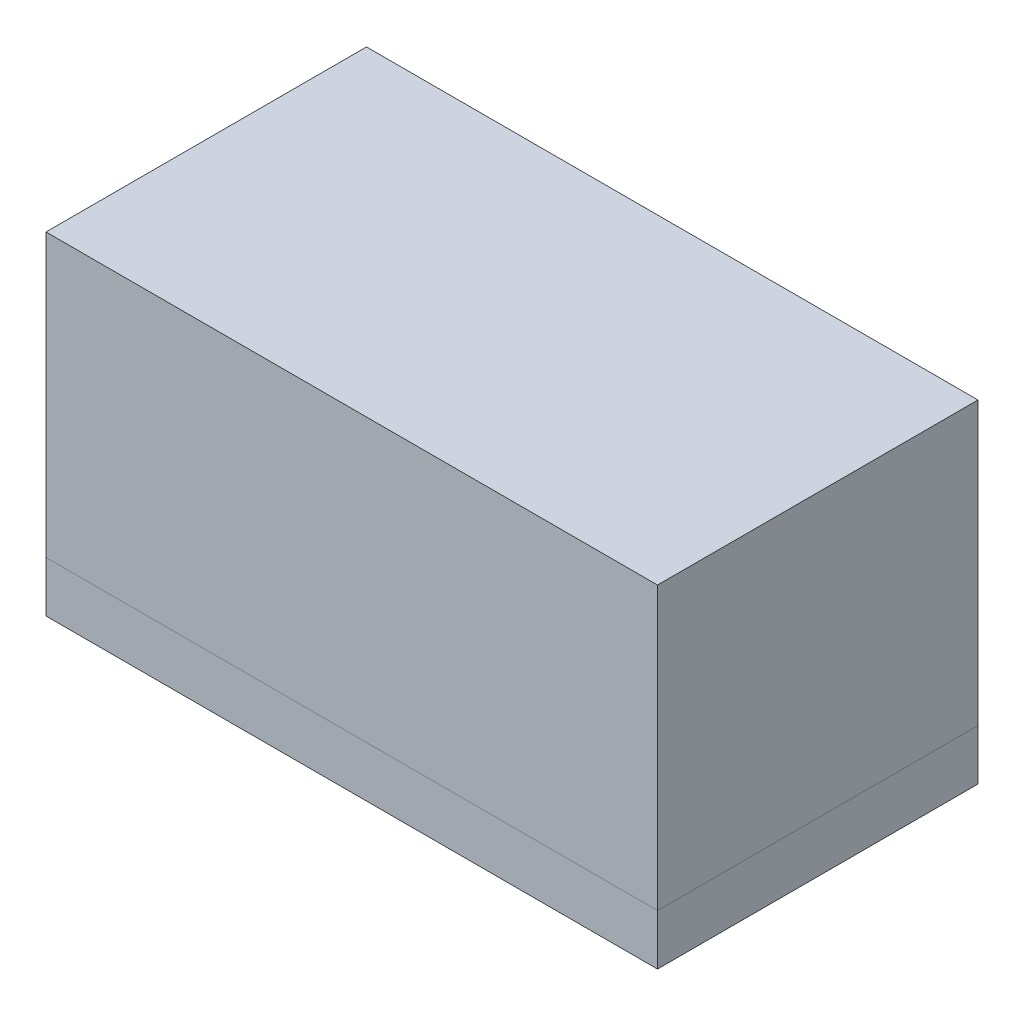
ISO-10303-21;
HEADER;
FILE_DESCRIPTION(('STEP AP214'),'2;1');
FILE_NAME('part.step','',(''),(''),'','','');
FILE_SCHEMA(('AUTOMOTIVE_DESIGN { 1 0 10303 214 1 1 1 1 }'));
ENDSEC;
DATA;
#1=APPLICATION_CONTEXT('core data for automotive mechanical design processes');
#2=APPLICATION_PROTOCOL_DEFINITION('international standard','automotive_design',2000,#1);
#3=PRODUCT_CONTEXT('',#1,'mechanical');
#4=PRODUCT('Part','Part','',(#3));
#5=PRODUCT_RELATED_PRODUCT_CATEGORY('part','',(#4));
#6=PRODUCT_DEFINITION_FORMATION('','',#4);
#7=PRODUCT_DEFINITION_CONTEXT('part definition',#1,'design');
#8=PRODUCT_DEFINITION('design','',#6,#7);
#9=PRODUCT_DEFINITION_SHAPE('','',#8);
#10=(LENGTH_UNIT() NAMED_UNIT(*) SI_UNIT(.MILLI.,.METRE.));
#11=(NAMED_UNIT(*) PLANE_ANGLE_UNIT() SI_UNIT($,.RADIAN.));
#12=(NAMED_UNIT(*) SI_UNIT($,.STERADIAN.) SOLID_ANGLE_UNIT());
#13=UNCERTAINTY_MEASURE_WITH_UNIT(LENGTH_MEASURE(1.E-05),#10,'distance_accuracy_value','');
#14=(GEOMETRIC_REPRESENTATION_CONTEXT(3) GLOBAL_UNCERTAINTY_ASSIGNED_CONTEXT((#13)) GLOBAL_UNIT_ASSIGNED_CONTEXT((#10,
#11,#12)) REPRESENTATION_CONTEXT('',''));
#15=CARTESIAN_POINT('',(0.,0.,0.));
#16=DIRECTION('',(0.,0.,1.));
#17=DIRECTION('',(1.,0.,0.));
#18=AXIS2_PLACEMENT_3D('',#15,#16,#17);
#19=CARTESIAN_POINT('',(-275.790977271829,-50.,-144.540977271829));
#20=DIRECTION('',(-1.,0.,0.));
#21=DIRECTION('',(0.,0.,1.));
#22=AXIS2_PLACEMENT_3D('',#19,#20,#21);
#23=PLANE('',#22);
#24=DIRECTION('',(0.,0.,-1.));
#25=VECTOR('',#24,1.);
#26=CARTESIAN_POINT('',(-275.790977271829,-4.26838748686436,-144.540977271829));
#27=LINE('',#26,#25);
#28=CARTESIAN_POINT('',(-275.790977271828,-4.26838748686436,144.540977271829));
#29=VERTEX_POINT('',#28);
#30=CARTESIAN_POINT('',(-275.790977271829,-4.26838748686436,-144.540977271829));
#31=VERTEX_POINT('',#30);
#32=EDGE_CURVE('E803',#29,#31,#27,.T.);
#33=ORIENTED_EDGE('',*,*,#32,.F.);
#34=DIRECTION('',(0.,1.,0.));
#35=VECTOR('',#34,1.);
#36=CARTESIAN_POINT('',(-275.790977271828,-50.,144.540977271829));
#37=LINE('',#36,#35);
#38=CARTESIAN_POINT('',(-275.790977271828,250.,144.540977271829));
#39=VERTEX_POINT('',#38);
#40=EDGE_CURVE('E700',#29,#39,#37,.T.);
#41=ORIENTED_EDGE('',*,*,#40,.T.);
#42=DIRECTION('',(0.,0.,1.));
#43=VECTOR('',#42,1.);
#44=CARTESIAN_POINT('',(-275.790977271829,250.,-144.540977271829));
#45=LINE('',#44,#43);
#46=CARTESIAN_POINT('',(-275.790977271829,250.,-144.540977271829));
#47=VERTEX_POINT('',#46);
#48=EDGE_CURVE('E816',#47,#39,#45,.T.);
#49=ORIENTED_EDGE('',*,*,#48,.F.);
#50=DIRECTION('',(0.,1.,0.));
#51=VECTOR('',#50,1.);
#52=CARTESIAN_POINT('',(-275.790977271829,-50.,-144.540977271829));
#53=LINE('',#52,#51);
#54=EDGE_CURVE('E809',#31,#47,#53,.T.);
#55=ORIENTED_EDGE('',*,*,#54,.F.);
#56=EDGE_LOOP('',(#33,#41,#49,#55));
#57=FACE_BOUND('',#56,.T.);
#58=ADVANCED_FACE('F696',(#57),#23,.T.);
#59=CARTESIAN_POINT('',(-275.790977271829,-50.,-144.540977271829));
#60=DIRECTION('',(0.,0.,-1.));
#61=DIRECTION('',(-1.,0.,0.));
#62=AXIS2_PLACEMENT_3D('',#59,#60,#61);
#63=PLANE('',#62);
#64=DIRECTION('',(1.,0.,0.));
#65=VECTOR('',#64,1.);
#66=CARTESIAN_POINT('',(-275.790977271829,-4.26838748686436,-144.540977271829));
#67=LINE('',#66,#65);
#68=CARTESIAN_POINT('',(275.790977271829,-4.26838748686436,-144.540977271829));
#69=VERTEX_POINT('',#68);
#70=EDGE_CURVE('E800',#31,#69,#67,.T.);
#71=ORIENTED_EDGE('',*,*,#70,.F.);
#72=ORIENTED_EDGE('',*,*,#54,.T.);
#73=DIRECTION('',(-1.,0.,0.));
#74=VECTOR('',#73,1.);
#75=CARTESIAN_POINT('',(-275.790977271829,250.,-144.540977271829));
#76=LINE('',#75,#74);
#77=CARTESIAN_POINT('',(275.790977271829,250.,-144.540977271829));
#78=VERTEX_POINT('',#77);
#79=EDGE_CURVE('E772',#78,#47,#76,.T.);
#80=ORIENTED_EDGE('',*,*,#79,.F.);
#81=DIRECTION('',(0.,1.,0.));
#82=VECTOR('',#81,1.);
#83=CARTESIAN_POINT('',(275.790977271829,-50.,-144.540977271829));
#84=LINE('',#83,#82);
#85=EDGE_CURVE('E812',#69,#78,#84,.T.);
#86=ORIENTED_EDGE('',*,*,#85,.F.);
#87=EDGE_LOOP('',(#71,#72,#80,#86));
#88=FACE_BOUND('',#87,.T.);
#89=ADVANCED_FACE('F918',(#88),#63,.T.);
#90=CARTESIAN_POINT('',(275.790977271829,-50.,-144.540977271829));
#91=DIRECTION('',(1.,0.,0.));
#92=DIRECTION('',(0.,0.,-1.));
#93=AXIS2_PLACEMENT_3D('',#90,#91,#92);
#94=PLANE('',#93);
#95=DIRECTION('',(0.,0.,1.));
#96=VECTOR('',#95,1.);
#97=CARTESIAN_POINT('',(275.790977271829,-4.26838748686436,-144.540977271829));
#98=LINE('',#97,#96);
#99=CARTESIAN_POINT('',(275.790977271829,-4.26838748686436,144.540977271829));
#100=VERTEX_POINT('',#99);
#101=EDGE_CURVE('E796',#69,#100,#98,.T.);
#102=ORIENTED_EDGE('',*,*,#101,.F.);
#103=ORIENTED_EDGE('',*,*,#85,.T.);
#104=DIRECTION('',(0.,0.,-1.));
#105=VECTOR('',#104,1.);
#106=CARTESIAN_POINT('',(275.790977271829,250.,-144.540977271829));
#107=LINE('',#106,#105);
#108=CARTESIAN_POINT('',(275.790977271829,250.,144.540977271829));
#109=VERTEX_POINT('',#108);
#110=EDGE_CURVE('E777',#109,#78,#107,.T.);
#111=ORIENTED_EDGE('',*,*,#110,.F.);
#112=DIRECTION('',(0.,1.,0.));
#113=VECTOR('',#112,1.);
#114=CARTESIAN_POINT('',(275.790977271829,-50.,144.540977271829));
#115=LINE('',#114,#113);
#116=EDGE_CURVE('E814',#100,#109,#115,.T.);
#117=ORIENTED_EDGE('',*,*,#116,.F.);
#118=EDGE_LOOP('',(#102,#103,#111,#117));
#119=FACE_BOUND('',#118,.T.);
#120=ADVANCED_FACE('F910',(#119),#94,.T.);
#121=CARTESIAN_POINT('',(-275.790977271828,-50.,144.540977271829));
#122=DIRECTION('',(0.,0.,1.));
#123=DIRECTION('',(1.,0.,0.));
#124=AXIS2_PLACEMENT_3D('',#121,#122,#123);
#125=PLANE('',#124);
#126=DIRECTION('',(-1.,0.,0.));
#127=VECTOR('',#126,1.);
#128=CARTESIAN_POINT('',(-275.790977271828,-4.26838748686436,144.540977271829));
#129=LINE('',#128,#127);
#130=EDGE_CURVE('E806',#100,#29,#129,.T.);
#131=ORIENTED_EDGE('',*,*,#130,.F.);
#132=ORIENTED_EDGE('',*,*,#116,.T.);
#133=DIRECTION('',(1.,0.,0.));
#134=VECTOR('',#133,1.);
#135=CARTESIAN_POINT('',(-275.790977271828,250.,144.540977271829));
#136=LINE('',#135,#134);
#137=EDGE_CURVE('E824',#39,#109,#136,.T.);
#138=ORIENTED_EDGE('',*,*,#137,.F.);
#139=ORIENTED_EDGE('',*,*,#40,.F.);
#140=EDGE_LOOP('',(#131,#132,#138,#139));
#141=FACE_BOUND('',#140,.T.);
#142=ADVANCED_FACE('F913',(#141),#125,.T.);
#143=CARTESIAN_POINT('',(0.,250.,0.));
#144=DIRECTION('',(0.,1.,0.));
#145=DIRECTION('',(0.,0.,1.));
#146=AXIS2_PLACEMENT_3D('',#143,#144,#145);
#147=PLANE('',#146);
#148=ORIENTED_EDGE('',*,*,#48,.T.);
#149=ORIENTED_EDGE('',*,*,#137,.T.);
#150=ORIENTED_EDGE('',*,*,#110,.T.);
#151=ORIENTED_EDGE('',*,*,#79,.T.);
#152=EDGE_LOOP('',(#148,#149,#150,#151));
#153=FACE_BOUND('',#152,.T.);
#154=ADVANCED_FACE('F921',(#153),#147,.T.);
#155=CARTESIAN_POINT('',(0.,126.981612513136,0.));
#156=DIRECTION('',(0.,-1.,0.));
#157=DIRECTION('',(0.,0.,-1.));
#158=AXIS2_PLACEMENT_3D('',#155,#156,#157);
#159=PLANE('',#158);
#160=DIRECTION('',(1.,0.,0.));
#161=VECTOR('',#160,1.);
#162=CARTESIAN_POINT('',(262.5,126.981612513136,131.25));
#163=LINE('',#162,#161);
#164=CARTESIAN_POINT('',(-257.250799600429,126.981612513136,131.25));
#165=VERTEX_POINT('',#164);
#166=CARTESIAN_POINT('',(257.250799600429,126.981612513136,131.25));
#167=VERTEX_POINT('',#166);
#168=EDGE_CURVE('E760',#165,#167,#163,.T.);
#169=ORIENTED_EDGE('',*,*,#168,.F.);
#170=CARTESIAN_POINT('',(-257.24920027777,126.981612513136,125.99920027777));
#171=DIRECTION('',(0.,1.,0.));
#172=DIRECTION('',(-0.707106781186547,0.,0.707106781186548));
#173=AXIS2_PLACEMENT_3D('',#170,#171,#172);
#174=ELLIPSE('',#173,5.25159932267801,5.25);
#175=CARTESIAN_POINT('',(-262.5,126.981612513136,126.000799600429));
#176=VERTEX_POINT('',#175);
#177=EDGE_CURVE('E789',#176,#165,#174,.T.);
#178=ORIENTED_EDGE('',*,*,#177,.F.);
#179=DIRECTION('',(0.,0.,1.));
#180=VECTOR('',#179,1.);
#181=CARTESIAN_POINT('',(-262.5,126.981612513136,131.25));
#182=LINE('',#181,#180);
#183=CARTESIAN_POINT('',(-262.5,126.981612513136,-126.000799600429));
#184=VERTEX_POINT('',#183);
#185=EDGE_CURVE('E787',#184,#176,#182,.T.);
#186=ORIENTED_EDGE('',*,*,#185,.F.);
#187=CARTESIAN_POINT('',(-257.249200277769,126.981612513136,-125.999200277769));
#188=DIRECTION('',(0.,1.,0.));
#189=DIRECTION('',(-0.707106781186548,0.,-0.707106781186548));
#190=AXIS2_PLACEMENT_3D('',#187,#188,#189);
#191=ELLIPSE('',#190,5.25159932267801,5.25);
#192=CARTESIAN_POINT('',(-257.250799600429,126.981612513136,-131.25));
#193=VERTEX_POINT('',#192);
#194=EDGE_CURVE('E783',#193,#184,#191,.T.);
#195=ORIENTED_EDGE('',*,*,#194,.F.);
#196=DIRECTION('',(-1.,0.,0.));
#197=VECTOR('',#196,1.);
#198=CARTESIAN_POINT('',(262.5,126.981612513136,-131.25));
#199=LINE('',#198,#197);
#200=CARTESIAN_POINT('',(257.250799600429,126.981612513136,-131.25));
#201=VERTEX_POINT('',#200);
#202=EDGE_CURVE('E781',#201,#193,#199,.T.);
#203=ORIENTED_EDGE('',*,*,#202,.F.);
#204=CARTESIAN_POINT('',(257.249200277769,126.981612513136,-125.999200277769));
#205=DIRECTION('',(0.,1.,0.));
#206=DIRECTION('',(0.707106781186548,0.,-0.707106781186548));
#207=AXIS2_PLACEMENT_3D('',#204,#205,#206);
#208=ELLIPSE('',#207,5.25159932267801,5.25);
#209=CARTESIAN_POINT('',(262.5,126.981612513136,-126.000799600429));
#210=VERTEX_POINT('',#209);
#211=EDGE_CURVE('E770',#210,#201,#208,.T.);
#212=ORIENTED_EDGE('',*,*,#211,.F.);
#213=DIRECTION('',(0.,0.,-1.));
#214=VECTOR('',#213,1.);
#215=CARTESIAN_POINT('',(262.5,126.981612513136,131.25));
#216=LINE('',#215,#214);
#217=CARTESIAN_POINT('',(262.5,126.981612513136,126.000799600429));
#218=VERTEX_POINT('',#217);
#219=EDGE_CURVE('E764',#218,#210,#216,.T.);
#220=ORIENTED_EDGE('',*,*,#219,.F.);
#221=CARTESIAN_POINT('',(257.249200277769,126.981612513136,125.999200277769));
#222=DIRECTION('',(0.,1.,0.));
#223=DIRECTION('',(0.707106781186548,0.,0.707106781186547));
#224=AXIS2_PLACEMENT_3D('',#221,#222,#223);
#225=ELLIPSE('',#224,5.25159932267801,5.25);
#226=EDGE_CURVE('E750',#167,#218,#225,.T.);
#227=ORIENTED_EDGE('',*,*,#226,.F.);
#228=EDGE_LOOP('',(#169,#178,#186,#195,#203,#212,#220,#227));
#229=FACE_BOUND('',#228,.T.);
#230=ADVANCED_FACE('F768',(#229),#159,.T.);
#231=CARTESIAN_POINT('',(262.5,126.981612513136,131.25));
#232=DIRECTION('',(0.999847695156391,0.0174524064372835,0.));
#233=DIRECTION('',(-0.0174524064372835,0.999847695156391,0.));
#234=AXIS2_PLACEMENT_3D('',#231,#232,#233);
#235=PLANE('',#234);
#236=ORIENTED_EDGE('',*,*,#219,.T.);
#237=DIRECTION('',(-0.0174497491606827,0.999695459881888,0.0174497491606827));
#238=VECTOR('',#237,1.);
#239=CARTESIAN_POINT('',(262.421668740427,131.469207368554,-125.922468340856));
#240=LINE('',#239,#238);
#241=CARTESIAN_POINT('',(264.790977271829,-4.26838748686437,-128.291776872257));
#242=VERTEX_POINT('',#241);
#243=EDGE_CURVE('E784',#242,#210,#240,.T.);
#244=ORIENTED_EDGE('',*,*,#243,.F.);
#245=DIRECTION('',(0.,0.,1.));
#246=VECTOR('',#245,1.);
#247=CARTESIAN_POINT('',(264.790977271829,-4.26838748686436,131.25));
#248=LINE('',#247,#246);
#249=CARTESIAN_POINT('',(264.790977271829,-4.26838748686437,128.291776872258));
#250=VERTEX_POINT('',#249);
#251=EDGE_CURVE('E14',#250,#242,#248,.F.);
#252=ORIENTED_EDGE('',*,*,#251,.F.);
#253=DIRECTION('',(-0.0174497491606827,0.999695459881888,-0.0174497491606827));
#254=VECTOR('',#253,1.);
#255=CARTESIAN_POINT('',(262.501598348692,126.8900431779,126.002397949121));
#256=LINE('',#255,#254);
#257=EDGE_CURVE('E754',#218,#250,#256,.F.);
#258=ORIENTED_EDGE('',*,*,#257,.F.);
#259=EDGE_LOOP('',(#236,#244,#252,#258));
#260=FACE_BOUND('',#259,.T.);
#261=ADVANCED_FACE('F763',(#260),#235,.F.);
#262=CARTESIAN_POINT('',(257.252397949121,126.798418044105,-126.002397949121));
#263=DIRECTION('',(0.0174497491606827,-0.999695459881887,-0.0174497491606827));
#264=DIRECTION('',(0.,0.0174524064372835,-0.999847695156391));
#265=AXIS2_PLACEMENT_3D('',#262,#263,#264);
#266=CYLINDRICAL_SURFACE('',#265,5.25);
#267=ORIENTED_EDGE('',*,*,#211,.T.);
#268=DIRECTION('',(-0.0174497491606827,0.999695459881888,0.0174497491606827));
#269=VECTOR('',#268,1.);
#270=CARTESIAN_POINT('',(257.252397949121,126.8900431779,-131.251598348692));
#271=LINE('',#270,#269);
#272=CARTESIAN_POINT('',(259.541776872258,-4.26838748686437,-133.540977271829));
#273=VERTEX_POINT('',#272);
#274=EDGE_CURVE('E774',#201,#273,#271,.F.);
#275=ORIENTED_EDGE('',*,*,#274,.T.);
#276=CARTESIAN_POINT('',(259.540177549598,-4.26838748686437,-128.290177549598));
#277=DIRECTION('',(0.,1.,0.));
#278=DIRECTION('',(0.707106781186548,0.,-0.707106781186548));
#279=AXIS2_PLACEMENT_3D('',#276,#277,#278);
#280=ELLIPSE('',#279,5.25159932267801,5.25);
#281=EDGE_CURVE('E862',#273,#242,#280,.F.);
#282=ORIENTED_EDGE('',*,*,#281,.T.);
#283=ORIENTED_EDGE('',*,*,#243,.T.);
#284=EDGE_LOOP('',(#267,#275,#282,#283));
#285=FACE_BOUND('',#284,.T.);
#286=ADVANCED_FACE('F868',(#285),#266,.F.);
#287=CARTESIAN_POINT('',(262.5,126.981612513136,-131.25));
#288=DIRECTION('',(0.,0.0174524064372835,-0.999847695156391));
#289=DIRECTION('',(0.,0.999847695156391,0.0174524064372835));
#290=AXIS2_PLACEMENT_3D('',#287,#288,#289);
#291=PLANE('',#290);
#292=ORIENTED_EDGE('',*,*,#202,.T.);
#293=DIRECTION('',(0.0174497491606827,0.999695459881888,0.0174497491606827));
#294=VECTOR('',#293,1.);
#295=CARTESIAN_POINT('',(-257.092538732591,136.048371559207,-131.091739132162));
#296=LINE('',#295,#294);
#297=CARTESIAN_POINT('',(-259.541776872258,-4.26838748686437,-133.540977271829));
#298=VERTEX_POINT('',#297);
#299=EDGE_CURVE('E790',#298,#193,#296,.T.);
#300=ORIENTED_EDGE('',*,*,#299,.F.);
#301=DIRECTION('',(1.,0.,0.));
#302=VECTOR('',#301,1.);
#303=CARTESIAN_POINT('',(262.5,-4.26838748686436,-133.540977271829));
#304=LINE('',#303,#302);
#305=EDGE_CURVE('E799',#273,#298,#304,.F.);
#306=ORIENTED_EDGE('',*,*,#305,.F.);
#307=ORIENTED_EDGE('',*,*,#274,.F.);
#308=EDGE_LOOP('',(#292,#300,#306,#307));
#309=FACE_BOUND('',#308,.T.);
#310=ADVANCED_FACE('F875',(#309),#291,.F.);
#311=CARTESIAN_POINT('',(-257.172468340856,131.377582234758,-125.922468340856));
#312=DIRECTION('',(-0.0174497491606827,-0.999695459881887,-0.0174497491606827));
#313=DIRECTION('',(0.,0.0174524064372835,-0.999847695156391));
#314=AXIS2_PLACEMENT_3D('',#311,#312,#313);
#315=CYLINDRICAL_SURFACE('',#314,5.25);
#316=ORIENTED_EDGE('',*,*,#194,.T.);
#317=DIRECTION('',(0.0174497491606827,0.999695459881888,0.0174497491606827));
#318=VECTOR('',#317,1.);
#319=CARTESIAN_POINT('',(-262.421668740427,131.469207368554,-125.922468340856));
#320=LINE('',#319,#318);
#321=CARTESIAN_POINT('',(-264.790977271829,-4.26838748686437,-128.291776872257));
#322=VERTEX_POINT('',#321);
#323=EDGE_CURVE('E786',#184,#322,#320,.F.);
#324=ORIENTED_EDGE('',*,*,#323,.T.);
#325=CARTESIAN_POINT('',(-259.540177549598,-4.26838748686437,-128.290177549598));
#326=DIRECTION('',(0.,1.,0.));
#327=DIRECTION('',(-0.707106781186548,0.,-0.707106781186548));
#328=AXIS2_PLACEMENT_3D('',#325,#326,#327);
#329=ELLIPSE('',#328,5.25159932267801,5.25);
#330=EDGE_CURVE('E851',#322,#298,#329,.F.);
#331=ORIENTED_EDGE('',*,*,#330,.T.);
#332=ORIENTED_EDGE('',*,*,#299,.T.);
#333=EDGE_LOOP('',(#316,#324,#331,#332));
#334=FACE_BOUND('',#333,.T.);
#335=ADVANCED_FACE('F878',(#334),#315,.F.);
#336=CARTESIAN_POINT('',(-262.5,126.981612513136,131.25));
#337=DIRECTION('',(-0.999847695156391,0.0174524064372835,0.));
#338=DIRECTION('',(-0.0174524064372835,-0.999847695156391,0.));
#339=AXIS2_PLACEMENT_3D('',#336,#337,#338);
#340=PLANE('',#339);
#341=DIRECTION('',(0.,0.,-1.));
#342=VECTOR('',#341,1.);
#343=CARTESIAN_POINT('',(-264.790977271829,-4.26838748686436,131.25));
#344=LINE('',#343,#342);
#345=CARTESIAN_POINT('',(-264.790977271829,-4.26838748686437,128.291776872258));
#346=VERTEX_POINT('',#345);
#347=EDGE_CURVE('E839',#322,#346,#344,.F.);
#348=ORIENTED_EDGE('',*,*,#347,.F.);
#349=ORIENTED_EDGE('',*,*,#323,.F.);
#350=ORIENTED_EDGE('',*,*,#185,.T.);
#351=DIRECTION('',(0.0174497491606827,0.999695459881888,-0.0174497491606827));
#352=VECTOR('',#351,1.);
#353=CARTESIAN_POINT('',(-262.501598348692,126.8900431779,126.002397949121));
#354=LINE('',#353,#352);
#355=EDGE_CURVE('E795',#346,#176,#354,.T.);
#356=ORIENTED_EDGE('',*,*,#355,.F.);
#357=EDGE_LOOP('',(#348,#349,#350,#356));
#358=FACE_BOUND('',#357,.T.);
#359=ADVANCED_FACE('F883',(#358),#340,.F.);
#360=CARTESIAN_POINT('',(-257.092538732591,135.956746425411,125.842538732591));
#361=DIRECTION('',(-0.0174497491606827,-0.999695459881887,0.0174497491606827));
#362=DIRECTION('',(0.,-0.0174524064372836,-0.999847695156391));
#363=AXIS2_PLACEMENT_3D('',#360,#361,#362);
#364=CYLINDRICAL_SURFACE('',#363,5.25);
#365=ORIENTED_EDGE('',*,*,#177,.T.);
#366=DIRECTION('',(0.0174497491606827,0.999695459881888,-0.0174497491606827));
#367=VECTOR('',#366,1.);
#368=CARTESIAN_POINT('',(-257.092538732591,136.048371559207,131.091739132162));
#369=LINE('',#368,#367);
#370=CARTESIAN_POINT('',(-259.541776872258,-4.26838748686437,133.540977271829));
#371=VERTEX_POINT('',#370);
#372=EDGE_CURVE('E793',#165,#371,#369,.F.);
#373=ORIENTED_EDGE('',*,*,#372,.T.);
#374=CARTESIAN_POINT('',(-259.540177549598,-4.26838748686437,128.290177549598));
#375=DIRECTION('',(0.,1.,0.));
#376=DIRECTION('',(-0.707106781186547,0.,0.707106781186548));
#377=AXIS2_PLACEMENT_3D('',#374,#375,#376);
#378=ELLIPSE('',#377,5.25159932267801,5.25);
#379=EDGE_CURVE('E840',#371,#346,#378,.F.);
#380=ORIENTED_EDGE('',*,*,#379,.T.);
#381=ORIENTED_EDGE('',*,*,#355,.T.);
#382=EDGE_LOOP('',(#365,#373,#380,#381));
#383=FACE_BOUND('',#382,.T.);
#384=ADVANCED_FACE('F948',(#383),#364,.F.);
#385=CARTESIAN_POINT('',(262.5,126.981612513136,131.25));
#386=DIRECTION('',(0.,0.0174524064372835,0.999847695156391));
#387=DIRECTION('',(0.,-0.999847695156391,0.0174524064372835));
#388=AXIS2_PLACEMENT_3D('',#385,#386,#387);
#389=PLANE('',#388);
#390=DIRECTION('',(-1.,0.,0.));
#391=VECTOR('',#390,1.);
#392=CARTESIAN_POINT('',(262.5,-4.26838748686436,133.540977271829));
#393=LINE('',#392,#391);
#394=CARTESIAN_POINT('',(259.541776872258,-4.26838748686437,133.540977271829));
#395=VERTEX_POINT('',#394);
#396=EDGE_CURVE('E708',#371,#395,#393,.F.);
#397=ORIENTED_EDGE('',*,*,#396,.F.);
#398=ORIENTED_EDGE('',*,*,#372,.F.);
#399=ORIENTED_EDGE('',*,*,#168,.T.);
#400=DIRECTION('',(-0.0174497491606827,0.999695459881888,-0.0174497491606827));
#401=VECTOR('',#400,1.);
#402=CARTESIAN_POINT('',(257.252397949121,126.8900431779,131.251598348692));
#403=LINE('',#402,#401);
#404=EDGE_CURVE('E756',#395,#167,#403,.T.);
#405=ORIENTED_EDGE('',*,*,#404,.F.);
#406=EDGE_LOOP('',(#397,#398,#399,#405));
#407=FACE_BOUND('',#406,.T.);
#408=ADVANCED_FACE('F951',(#407),#389,.F.);
#409=CARTESIAN_POINT('',(257.252397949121,126.798418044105,126.002397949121));
#410=DIRECTION('',(0.0174497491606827,-0.999695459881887,0.0174497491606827));
#411=DIRECTION('',(0.999847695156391,0.0174524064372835,0.));
#412=AXIS2_PLACEMENT_3D('',#409,#410,#411);
#413=CYLINDRICAL_SURFACE('',#412,5.25);
#414=ORIENTED_EDGE('',*,*,#226,.T.);
#415=ORIENTED_EDGE('',*,*,#257,.T.);
#416=CARTESIAN_POINT('',(259.540177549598,-4.26838748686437,128.290177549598));
#417=DIRECTION('',(0.,1.,0.));
#418=DIRECTION('',(0.707106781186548,0.,0.707106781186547));
#419=AXIS2_PLACEMENT_3D('',#416,#417,#418);
#420=ELLIPSE('',#419,5.25159932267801,5.25);
#421=EDGE_CURVE('E766',#250,#395,#420,.F.);
#422=ORIENTED_EDGE('',*,*,#421,.T.);
#423=ORIENTED_EDGE('',*,*,#404,.T.);
#424=EDGE_LOOP('',(#414,#415,#422,#423));
#425=FACE_BOUND('',#424,.T.);
#426=ADVANCED_FACE('F752',(#425),#413,.F.);
#427=CARTESIAN_POINT('',(259.541776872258,-4.26838748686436,-133.540977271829));
#428=DIRECTION('',(0.,1.,0.));
#429=DIRECTION('',(0.70710678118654,0.,0.707106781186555));
#430=AXIS2_PLACEMENT_3D('',#427,#428,#429);
#431=PLANE('',#430);
#432=ORIENTED_EDGE('',*,*,#130,.T.);
#433=ORIENTED_EDGE('',*,*,#32,.T.);
#434=ORIENTED_EDGE('',*,*,#70,.T.);
#435=ORIENTED_EDGE('',*,*,#101,.T.);
#436=EDGE_LOOP('',(#432,#433,#434,#435));
#437=FACE_BOUND('',#436,.T.);
#438=ORIENTED_EDGE('',*,*,#281,.F.);
#439=ORIENTED_EDGE('',*,*,#305,.T.);
#440=ORIENTED_EDGE('',*,*,#330,.F.);
#441=ORIENTED_EDGE('',*,*,#347,.T.);
#442=ORIENTED_EDGE('',*,*,#379,.F.);
#443=ORIENTED_EDGE('',*,*,#396,.T.);
#444=ORIENTED_EDGE('',*,*,#421,.F.);
#445=ORIENTED_EDGE('',*,*,#251,.T.);
#446=EDGE_LOOP('',(#438,#439,#440,#441,#442,#443,#444,#445));
#447=FACE_BOUND('',#446,.T.);
#448=ADVANCED_FACE('F698',(#437,#447),#431,.F.);
#449=CLOSED_SHELL('',(#58,#89,#120,#142,#154,#230,#261,#286,#310,#335,#359,#384,#408,#426,#448));
#450=MANIFOLD_SOLID_BREP('B2_NOT_SHOWN',#449);
#451=CARTESIAN_POINT('',(0.,-50.,0.));
#452=DIRECTION('',(0.,1.,0.));
#453=DIRECTION('',(0.,0.,1.));
#454=AXIS2_PLACEMENT_3D('',#451,#452,#453);
#455=PLANE('',#454);
#456=DIRECTION('',(0.,0.,1.));
#457=VECTOR('',#456,1.);
#458=CARTESIAN_POINT('',(-275.790977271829,-50.,-144.540977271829));
#459=LINE('',#458,#457);
#460=CARTESIAN_POINT('',(-275.790977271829,-50.,-144.540977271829));
#461=VERTEX_POINT('',#460);
#462=CARTESIAN_POINT('',(-275.790977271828,-50.,144.540977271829));
#463=VERTEX_POINT('',#462);
#464=EDGE_CURVE('E1333',#461,#463,#459,.T.);
#465=ORIENTED_EDGE('',*,*,#464,.F.);
#466=DIRECTION('',(-1.,0.,0.));
#467=VECTOR('',#466,1.);
#468=CARTESIAN_POINT('',(-275.790977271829,-50.,-144.540977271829));
#469=LINE('',#468,#467);
#470=CARTESIAN_POINT('',(275.790977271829,-50.,-144.540977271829));
#471=VERTEX_POINT('',#470);
#472=EDGE_CURVE('E1328',#471,#461,#469,.T.);
#473=ORIENTED_EDGE('',*,*,#472,.F.);
#474=DIRECTION('',(0.,0.,-1.));
#475=VECTOR('',#474,1.);
#476=CARTESIAN_POINT('',(275.790977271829,-50.,-144.540977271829));
#477=LINE('',#476,#475);
#478=CARTESIAN_POINT('',(275.790977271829,-50.,144.540977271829));
#479=VERTEX_POINT('',#478);
#480=EDGE_CURVE('E1336',#479,#471,#477,.T.);
#481=ORIENTED_EDGE('',*,*,#480,.F.);
#482=DIRECTION('',(1.,0.,0.));
#483=VECTOR('',#482,1.);
#484=CARTESIAN_POINT('',(-275.790977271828,-50.,144.540977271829));
#485=LINE('',#484,#483);
#486=EDGE_CURVE('E1323',#463,#479,#485,.T.);
#487=ORIENTED_EDGE('',*,*,#486,.F.);
#488=EDGE_LOOP('',(#465,#473,#481,#487));
#489=FACE_BOUND('',#488,.T.);
#490=ADVANCED_FACE('F1196',(#489),#455,.F.);
#491=CARTESIAN_POINT('',(-275.790977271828,-50.,144.540977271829));
#492=DIRECTION('',(0.,0.,1.));
#493=DIRECTION('',(1.,0.,0.));
#494=AXIS2_PLACEMENT_3D('',#491,#492,#493);
#495=PLANE('',#494);
#496=DIRECTION('',(0.,1.,0.));
#497=VECTOR('',#496,1.);
#498=CARTESIAN_POINT('',(275.790977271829,-50.,144.540977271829));
#499=LINE('',#498,#497);
#500=CARTESIAN_POINT('',(275.790977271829,-4.26838748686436,144.540977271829));
#501=VERTEX_POINT('',#500);
#502=EDGE_CURVE('E1327',#479,#501,#499,.T.);
#503=ORIENTED_EDGE('',*,*,#502,.T.);
#504=DIRECTION('',(-1.,0.,0.));
#505=VECTOR('',#504,1.);
#506=CARTESIAN_POINT('',(-275.790977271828,-4.26838748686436,144.540977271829));
#507=LINE('',#506,#505);
#508=CARTESIAN_POINT('',(-275.790977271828,-4.26838748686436,144.540977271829));
#509=VERTEX_POINT('',#508);
#510=EDGE_CURVE('E1200',#501,#509,#507,.T.);
#511=ORIENTED_EDGE('',*,*,#510,.T.);
#512=DIRECTION('',(0.,1.,0.));
#513=VECTOR('',#512,1.);
#514=CARTESIAN_POINT('',(-275.790977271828,-50.,144.540977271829));
#515=LINE('',#514,#513);
#516=EDGE_CURVE('E1319',#463,#509,#515,.T.);
#517=ORIENTED_EDGE('',*,*,#516,.F.);
#518=ORIENTED_EDGE('',*,*,#486,.T.);
#519=EDGE_LOOP('',(#503,#511,#517,#518));
#520=FACE_BOUND('',#519,.T.);
#521=ADVANCED_FACE('F1322',(#520),#495,.T.);
#522=CARTESIAN_POINT('',(275.790977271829,-50.,-144.540977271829));
#523=DIRECTION('',(1.,0.,0.));
#524=DIRECTION('',(0.,0.,-1.));
#525=AXIS2_PLACEMENT_3D('',#522,#523,#524);
#526=PLANE('',#525);
#527=DIRECTION('',(0.,1.,0.));
#528=VECTOR('',#527,1.);
#529=CARTESIAN_POINT('',(275.790977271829,-50.,-144.540977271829));
#530=LINE('',#529,#528);
#531=CARTESIAN_POINT('',(275.790977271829,-4.26838748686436,-144.540977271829));
#532=VERTEX_POINT('',#531);
#533=EDGE_CURVE('E1348',#471,#532,#530,.T.);
#534=ORIENTED_EDGE('',*,*,#533,.T.);
#535=DIRECTION('',(0.,0.,1.));
#536=VECTOR('',#535,1.);
#537=CARTESIAN_POINT('',(275.790977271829,-4.26838748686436,-144.540977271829));
#538=LINE('',#537,#536);
#539=EDGE_CURVE('E1354',#532,#501,#538,.T.);
#540=ORIENTED_EDGE('',*,*,#539,.T.);
#541=ORIENTED_EDGE('',*,*,#502,.F.);
#542=ORIENTED_EDGE('',*,*,#480,.T.);
#543=EDGE_LOOP('',(#534,#540,#541,#542));
#544=FACE_BOUND('',#543,.T.);
#545=ADVANCED_FACE('F1353',(#544),#526,.T.);
#546=CARTESIAN_POINT('',(-275.790977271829,-50.,-144.540977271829));
#547=DIRECTION('',(0.,0.,-1.));
#548=DIRECTION('',(-1.,0.,0.));
#549=AXIS2_PLACEMENT_3D('',#546,#547,#548);
#550=PLANE('',#549);
#551=DIRECTION('',(0.,1.,0.));
#552=VECTOR('',#551,1.);
#553=CARTESIAN_POINT('',(-275.790977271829,-50.,-144.540977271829));
#554=LINE('',#553,#552);
#555=CARTESIAN_POINT('',(-275.790977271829,-4.26838748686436,-144.540977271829));
#556=VERTEX_POINT('',#555);
#557=EDGE_CURVE('E1339',#461,#556,#554,.T.);
#558=ORIENTED_EDGE('',*,*,#557,.T.);
#559=DIRECTION('',(1.,0.,0.));
#560=VECTOR('',#559,1.);
#561=CARTESIAN_POINT('',(-275.790977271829,-4.26838748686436,-144.540977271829));
#562=LINE('',#561,#560);
#563=EDGE_CURVE('E1358',#556,#532,#562,.T.);
#564=ORIENTED_EDGE('',*,*,#563,.T.);
#565=ORIENTED_EDGE('',*,*,#533,.F.);
#566=ORIENTED_EDGE('',*,*,#472,.T.);
#567=EDGE_LOOP('',(#558,#564,#565,#566));
#568=FACE_BOUND('',#567,.T.);
#569=ADVANCED_FACE('F1534',(#568),#550,.T.);
#570=CARTESIAN_POINT('',(-275.790977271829,-50.,-144.540977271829));
#571=DIRECTION('',(-1.,0.,0.));
#572=DIRECTION('',(0.,0.,1.));
#573=AXIS2_PLACEMENT_3D('',#570,#571,#572);
#574=PLANE('',#573);
#575=ORIENTED_EDGE('',*,*,#516,.T.);
#576=DIRECTION('',(0.,0.,-1.));
#577=VECTOR('',#576,1.);
#578=CARTESIAN_POINT('',(-275.790977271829,-4.26838748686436,-144.540977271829));
#579=LINE('',#578,#577);
#580=EDGE_CURVE('E1342',#509,#556,#579,.T.);
#581=ORIENTED_EDGE('',*,*,#580,.T.);
#582=ORIENTED_EDGE('',*,*,#557,.F.);
#583=ORIENTED_EDGE('',*,*,#464,.T.);
#584=EDGE_LOOP('',(#575,#581,#582,#583));
#585=FACE_BOUND('',#584,.T.);
#586=ADVANCED_FACE('F1198',(#585),#574,.T.);
#587=CARTESIAN_POINT('',(0.,126.981612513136,0.));
#588=DIRECTION('',(0.,-1.,0.));
#589=DIRECTION('',(0.,0.,-1.));
#590=AXIS2_PLACEMENT_3D('',#587,#588,#589);
#591=PLANE('',#590);
#592=CARTESIAN_POINT('',(-249.9,126.981612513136,118.65));
#593=DIRECTION('',(0.,-1.,0.));
#594=DIRECTION('',(0.,0.,-1.));
#595=AXIS2_PLACEMENT_3D('',#592,#593,#594);
#596=CIRCLE('',#595,5.24999999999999);
#597=CARTESIAN_POINT('',(-249.9,126.981612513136,113.4));
#598=VERTEX_POINT('',#597);
#599=EDGE_CURVE('E1357',#598,#598,#596,.T.);
#600=ORIENTED_EDGE('',*,*,#599,.F.);
#601=EDGE_LOOP('',(#600));
#602=FACE_BOUND('',#601,.T.);
#603=ADVANCED_FACE('F1386',(#602),#591,.F.);
#604=CARTESIAN_POINT('',(251.924066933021,126.035998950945,-120.674066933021));
#605=DIRECTION('',(-0.0174497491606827,0.999695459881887,0.0174497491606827));
#606=DIRECTION('',(0.,-0.0174524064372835,0.999847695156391));
#607=AXIS2_PLACEMENT_3D('',#604,#605,#606);
#608=CYLINDRICAL_SURFACE('',#607,5.25);
#609=CARTESIAN_POINT('',(251.99920027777,121.731612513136,-120.749200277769));
#610=DIRECTION('',(0.,1.,0.));
#611=DIRECTION('',(-0.707106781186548,0.,0.707106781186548));
#612=AXIS2_PLACEMENT_3D('',#609,#610,#611);
#613=ELLIPSE('',#612,5.25159932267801,5.25);
#614=CARTESIAN_POINT('',(252.000799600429,121.731612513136,-126.));
#615=VERTEX_POINT('',#614);
#616=CARTESIAN_POINT('',(257.25,121.731612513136,-120.750799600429));
#617=VERTEX_POINT('',#616);
#618=EDGE_CURVE('E1362',#615,#617,#613,.F.);
#619=ORIENTED_EDGE('',*,*,#618,.T.);
#620=DIRECTION('',(0.0174497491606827,-0.999695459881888,-0.0174497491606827));
#621=VECTOR('',#620,1.);
#622=CARTESIAN_POINT('',(259.450936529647,-4.35995682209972,-122.951736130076));
#623=LINE('',#622,#621);
#624=CARTESIAN_POINT('',(259.449338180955,-4.26838748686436,-122.950137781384));
#625=VERTEX_POINT('',#624);
#626=EDGE_CURVE('E1436',#617,#625,#623,.T.);
#627=ORIENTED_EDGE('',*,*,#626,.T.);
#628=CARTESIAN_POINT('',(254.198538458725,-4.26838748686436,-122.948538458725));
#629=DIRECTION('',(0.,1.,0.));
#630=DIRECTION('',(-0.707106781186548,0.,0.707106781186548));
#631=AXIS2_PLACEMENT_3D('',#628,#629,#630);
#632=ELLIPSE('',#631,5.25159932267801,5.25);
#633=CARTESIAN_POINT('',(254.200137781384,-4.26838748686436,-128.199338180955));
#634=VERTEX_POINT('',#633);
#635=EDGE_CURVE('E1275',#625,#634,#632,.T.);
#636=ORIENTED_EDGE('',*,*,#635,.T.);
#637=DIRECTION('',(0.0174497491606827,-0.999695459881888,-0.0174497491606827));
#638=VECTOR('',#637,1.);
#639=CARTESIAN_POINT('',(252.002397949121,121.6400431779,-126.001598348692));
#640=LINE('',#639,#638);
#641=EDGE_CURVE('E1437',#634,#615,#640,.F.);
#642=ORIENTED_EDGE('',*,*,#641,.T.);
#643=EDGE_LOOP('',(#619,#627,#636,#642));
#644=FACE_BOUND('',#643,.T.);
#645=ADVANCED_FACE('F1506',(#644),#608,.T.);
#646=CARTESIAN_POINT('',(262.5,121.731612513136,-126.));
#647=DIRECTION('',(0.,-0.0174524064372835,0.999847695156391));
#648=DIRECTION('',(0.,-0.999847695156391,-0.0174524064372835));
#649=AXIS2_PLACEMENT_3D('',#646,#647,#648);
#650=PLANE('',#649);
#651=DIRECTION('',(-1.,0.,0.));
#652=VECTOR('',#651,1.);
#653=CARTESIAN_POINT('',(262.5,-4.26838748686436,-128.199338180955));
#654=LINE('',#653,#652);
#655=CARTESIAN_POINT('',(-254.200137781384,-4.26838748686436,-128.199338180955));
#656=VERTEX_POINT('',#655);
#657=EDGE_CURVE('E1438',#634,#656,#654,.T.);
#658=ORIENTED_EDGE('',*,*,#657,.T.);
#659=DIRECTION('',(-0.0174497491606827,-0.999695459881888,-0.0174497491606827));
#660=VECTOR('',#659,1.);
#661=CARTESIAN_POINT('',(-254.201736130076,-4.35995682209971,-128.200936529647));
#662=LINE('',#661,#660);
#663=CARTESIAN_POINT('',(-252.000799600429,121.731612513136,-126.));
#664=VERTEX_POINT('',#663);
#665=EDGE_CURVE('E1486',#664,#656,#662,.T.);
#666=ORIENTED_EDGE('',*,*,#665,.F.);
#667=DIRECTION('',(-1.,0.,0.));
#668=VECTOR('',#667,1.);
#669=CARTESIAN_POINT('',(262.5,121.731612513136,-126.));
#670=LINE('',#669,#668);
#671=EDGE_CURVE('E1284',#615,#664,#670,.T.);
#672=ORIENTED_EDGE('',*,*,#671,.F.);
#673=ORIENTED_EDGE('',*,*,#641,.F.);
#674=EDGE_LOOP('',(#658,#666,#672,#673));
#675=FACE_BOUND('',#674,.T.);
#676=ADVANCED_FACE('F1507',(#675),#650,.F.);
#677=CARTESIAN_POINT('',(-251.844137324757,130.615163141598,-120.594137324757));
#678=DIRECTION('',(0.0174497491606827,0.999695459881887,0.0174497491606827));
#679=DIRECTION('',(0.,-0.0174524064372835,0.999847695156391));
#680=AXIS2_PLACEMENT_3D('',#677,#678,#679);
#681=CYLINDRICAL_SURFACE('',#680,5.25);
#682=CARTESIAN_POINT('',(-251.999200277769,121.731612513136,-120.749200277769));
#683=DIRECTION('',(0.,1.,0.));
#684=DIRECTION('',(0.707106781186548,0.,0.707106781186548));
#685=AXIS2_PLACEMENT_3D('',#682,#683,#684);
#686=ELLIPSE('',#685,5.25159932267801,5.25);
#687=CARTESIAN_POINT('',(-257.25,121.731612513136,-120.750799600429));
#688=VERTEX_POINT('',#687);
#689=EDGE_CURVE('E1483',#688,#664,#686,.F.);
#690=ORIENTED_EDGE('',*,*,#689,.T.);
#691=ORIENTED_EDGE('',*,*,#665,.T.);
#692=CARTESIAN_POINT('',(-254.198538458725,-4.26838748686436,-122.948538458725));
#693=DIRECTION('',(0.,1.,0.));
#694=DIRECTION('',(0.707106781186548,0.,0.707106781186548));
#695=AXIS2_PLACEMENT_3D('',#692,#693,#694);
#696=ELLIPSE('',#695,5.25159932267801,5.25);
#697=CARTESIAN_POINT('',(-259.449338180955,-4.26838748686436,-122.950137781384));
#698=VERTEX_POINT('',#697);
#699=EDGE_CURVE('E1440',#656,#698,#696,.T.);
#700=ORIENTED_EDGE('',*,*,#699,.T.);
#701=DIRECTION('',(-0.0174497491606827,-0.999695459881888,-0.0174497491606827));
#702=VECTOR('',#701,1.);
#703=CARTESIAN_POINT('',(-257.251598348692,121.6400431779,-120.752397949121));
#704=LINE('',#703,#702);
#705=EDGE_CURVE('E1443',#698,#688,#704,.F.);
#706=ORIENTED_EDGE('',*,*,#705,.T.);
#707=EDGE_LOOP('',(#690,#691,#700,#706));
#708=FACE_BOUND('',#707,.T.);
#709=ADVANCED_FACE('F1513',(#708),#681,.T.);
#710=CARTESIAN_POINT('',(-257.25,121.731612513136,131.25));
#711=DIRECTION('',(0.999847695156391,-0.0174524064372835,0.));
#712=DIRECTION('',(0.0174524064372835,0.999847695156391,0.));
#713=AXIS2_PLACEMENT_3D('',#710,#711,#712);
#714=PLANE('',#713);
#715=DIRECTION('',(0.,0.,1.));
#716=VECTOR('',#715,1.);
#717=CARTESIAN_POINT('',(-257.25,121.731612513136,131.25));
#718=LINE('',#717,#716);
#719=CARTESIAN_POINT('',(-257.25,121.731612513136,120.750799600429));
#720=VERTEX_POINT('',#719);
#721=EDGE_CURVE('E1442',#688,#720,#718,.T.);
#722=ORIENTED_EDGE('',*,*,#721,.F.);
#723=ORIENTED_EDGE('',*,*,#705,.F.);
#724=DIRECTION('',(0.,0.,1.));
#725=VECTOR('',#724,1.);
#726=CARTESIAN_POINT('',(-259.449338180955,-4.26838748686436,131.25));
#727=LINE('',#726,#725);
#728=CARTESIAN_POINT('',(-259.449338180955,-4.26838748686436,122.950137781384));
#729=VERTEX_POINT('',#728);
#730=EDGE_CURVE('E1444',#698,#729,#727,.T.);
#731=ORIENTED_EDGE('',*,*,#730,.T.);
#732=DIRECTION('',(-0.0174497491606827,-0.999695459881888,0.0174497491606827));
#733=VECTOR('',#732,1.);
#734=CARTESIAN_POINT('',(-259.450936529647,-4.35995682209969,122.951736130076));
#735=LINE('',#734,#733);
#736=EDGE_CURVE('E1447',#720,#729,#735,.T.);
#737=ORIENTED_EDGE('',*,*,#736,.F.);
#738=EDGE_LOOP('',(#722,#723,#731,#737));
#739=FACE_BOUND('',#738,.T.);
#740=ADVANCED_FACE('F1576',(#739),#714,.F.);
#741=CARTESIAN_POINT('',(-252.003996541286,121.456834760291,120.753996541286));
#742=DIRECTION('',(0.0174497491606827,0.999695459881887,-0.0174497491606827));
#743=DIRECTION('',(0.,0.0174524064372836,0.999847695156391));
#744=AXIS2_PLACEMENT_3D('',#741,#742,#743);
#745=CYLINDRICAL_SURFACE('',#744,5.25);
#746=CARTESIAN_POINT('',(-251.99920027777,121.731612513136,120.74920027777));
#747=DIRECTION('',(0.,1.,0.));
#748=DIRECTION('',(0.707106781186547,0.,-0.707106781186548));
#749=AXIS2_PLACEMENT_3D('',#746,#747,#748);
#750=ELLIPSE('',#749,5.25159932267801,5.25);
#751=CARTESIAN_POINT('',(-252.000799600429,121.731612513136,126.));
#752=VERTEX_POINT('',#751);
#753=EDGE_CURVE('E1446',#752,#720,#750,.F.);
#754=ORIENTED_EDGE('',*,*,#753,.T.);
#755=ORIENTED_EDGE('',*,*,#736,.T.);
#756=CARTESIAN_POINT('',(-254.198538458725,-4.26838748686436,122.948538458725));
#757=DIRECTION('',(0.,1.,0.));
#758=DIRECTION('',(0.707106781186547,0.,-0.707106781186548));
#759=AXIS2_PLACEMENT_3D('',#756,#757,#758);
#760=ELLIPSE('',#759,5.25159932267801,5.25);
#761=CARTESIAN_POINT('',(-254.200137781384,-4.26838748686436,128.199338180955));
#762=VERTEX_POINT('',#761);
#763=EDGE_CURVE('E1448',#729,#762,#760,.T.);
#764=ORIENTED_EDGE('',*,*,#763,.T.);
#765=DIRECTION('',(-0.0174497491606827,-0.999695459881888,0.0174497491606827));
#766=VECTOR('',#765,1.);
#767=CARTESIAN_POINT('',(-252.002397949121,121.6400431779,126.001598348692));
#768=LINE('',#767,#766);
#769=EDGE_CURVE('E1451',#762,#752,#768,.F.);
#770=ORIENTED_EDGE('',*,*,#769,.T.);
#771=EDGE_LOOP('',(#754,#755,#764,#770));
#772=FACE_BOUND('',#771,.T.);
#773=ADVANCED_FACE('F1583',(#772),#745,.T.);
#774=CARTESIAN_POINT('',(262.5,121.731612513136,126.));
#775=DIRECTION('',(0.,-0.0174524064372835,-0.999847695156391));
#776=DIRECTION('',(0.,0.999847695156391,-0.0174524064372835));
#777=AXIS2_PLACEMENT_3D('',#774,#775,#776);
#778=PLANE('',#777);
#779=DIRECTION('',(1.,0.,0.));
#780=VECTOR('',#779,1.);
#781=CARTESIAN_POINT('',(262.5,-4.26838748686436,128.199338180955));
#782=LINE('',#781,#780);
#783=CARTESIAN_POINT('',(254.200137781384,-4.26838748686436,128.199338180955));
#784=VERTEX_POINT('',#783);
#785=EDGE_CURVE('E1450',#762,#784,#782,.T.);
#786=ORIENTED_EDGE('',*,*,#785,.T.);
#787=DIRECTION('',(0.0174497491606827,-0.999695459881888,0.0174497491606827));
#788=VECTOR('',#787,1.);
#789=CARTESIAN_POINT('',(254.201736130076,-4.35995682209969,128.200936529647));
#790=LINE('',#789,#788);
#791=CARTESIAN_POINT('',(252.000799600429,121.731612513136,126.));
#792=VERTEX_POINT('',#791);
#793=EDGE_CURVE('E1461',#792,#784,#790,.T.);
#794=ORIENTED_EDGE('',*,*,#793,.F.);
#795=DIRECTION('',(1.,0.,0.));
#796=VECTOR('',#795,1.);
#797=CARTESIAN_POINT('',(262.5,121.731612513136,126.));
#798=LINE('',#797,#796);
#799=EDGE_CURVE('E1452',#752,#792,#798,.T.);
#800=ORIENTED_EDGE('',*,*,#799,.F.);
#801=ORIENTED_EDGE('',*,*,#769,.F.);
#802=EDGE_LOOP('',(#786,#794,#800,#801));
#803=FACE_BOUND('',#802,.T.);
#804=ADVANCED_FACE('F1591',(#803),#778,.F.);
#805=CARTESIAN_POINT('',(-249.9,153.231612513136,-118.65));
#806=DIRECTION('',(0.,-1.,0.));
#807=DIRECTION('',(0.,0.,-1.));
#808=AXIS2_PLACEMENT_3D('',#805,#806,#807);
#809=CYLINDRICAL_SURFACE('',#808,5.24999999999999);
#810=CARTESIAN_POINT('',(-249.9,126.981612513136,-118.65));
#811=DIRECTION('',(0.,1.,0.));
#812=DIRECTION('',(0.,0.,1.));
#813=AXIS2_PLACEMENT_3D('',#810,#811,#812);
#814=CIRCLE('',#813,5.24999999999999);
#815=CARTESIAN_POINT('',(-249.9,126.981612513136,-113.4));
#816=VERTEX_POINT('',#815);
#817=EDGE_CURVE('E1464',#816,#816,#814,.F.);
#818=ORIENTED_EDGE('',*,*,#817,.T.);
#819=EDGE_LOOP('',(#818));
#820=FACE_BOUND('',#819,.T.);
#821=CARTESIAN_POINT('',(-249.9,121.731612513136,-118.65));
#822=DIRECTION('',(0.,1.,0.));
#823=DIRECTION('',(0.,0.,1.));
#824=AXIS2_PLACEMENT_3D('',#821,#822,#823);
#825=CIRCLE('',#824,5.24999999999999);
#826=CARTESIAN_POINT('',(-249.9,121.731612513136,-113.4));
#827=VERTEX_POINT('',#826);
#828=EDGE_CURVE('E1475',#827,#827,#825,.F.);
#829=ORIENTED_EDGE('',*,*,#828,.F.);
#830=EDGE_LOOP('',(#829));
#831=FACE_BOUND('',#830,.T.);
#832=ADVANCED_FACE('F1599',(#820,#831),#809,.T.);
#833=CARTESIAN_POINT('',(249.9,153.231612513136,-118.65));
#834=DIRECTION('',(0.,-1.,0.));
#835=DIRECTION('',(0.,0.,-1.));
#836=AXIS2_PLACEMENT_3D('',#833,#834,#835);
#837=CYLINDRICAL_SURFACE('',#836,5.24999999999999);
#838=CARTESIAN_POINT('',(249.9,126.981612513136,-118.65));
#839=DIRECTION('',(0.,1.,0.));
#840=DIRECTION('',(0.,0.,1.));
#841=AXIS2_PLACEMENT_3D('',#838,#839,#840);
#842=CIRCLE('',#841,5.24999999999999);
#843=CARTESIAN_POINT('',(249.9,126.981612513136,-113.4));
#844=VERTEX_POINT('',#843);
#845=EDGE_CURVE('E1474',#844,#844,#842,.F.);
#846=ORIENTED_EDGE('',*,*,#845,.T.);
#847=EDGE_LOOP('',(#846));
#848=FACE_BOUND('',#847,.T.);
#849=CARTESIAN_POINT('',(249.9,121.731612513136,-118.65));
#850=DIRECTION('',(0.,1.,0.));
#851=DIRECTION('',(0.,0.,1.));
#852=AXIS2_PLACEMENT_3D('',#849,#850,#851);
#853=CIRCLE('',#852,5.24999999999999);
#854=CARTESIAN_POINT('',(249.9,121.731612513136,-113.4));
#855=VERTEX_POINT('',#854);
#856=EDGE_CURVE('E1471',#855,#855,#853,.F.);
#857=ORIENTED_EDGE('',*,*,#856,.F.);
#858=EDGE_LOOP('',(#857));
#859=FACE_BOUND('',#858,.T.);
#860=ADVANCED_FACE('F1607',(#848,#859),#837,.T.);
#861=CARTESIAN_POINT('',(249.9,153.231612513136,118.65));
#862=DIRECTION('',(0.,-1.,0.));
#863=DIRECTION('',(0.,0.,-1.));
#864=AXIS2_PLACEMENT_3D('',#861,#862,#863);
#865=CYLINDRICAL_SURFACE('',#864,5.24999999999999);
#866=CARTESIAN_POINT('',(249.9,126.981612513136,118.65));
#867=DIRECTION('',(0.,1.,0.));
#868=DIRECTION('',(0.,0.,1.));
#869=AXIS2_PLACEMENT_3D('',#866,#867,#868);
#870=CIRCLE('',#869,5.24999999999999);
#871=CARTESIAN_POINT('',(249.9,126.981612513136,123.9));
#872=VERTEX_POINT('',#871);
#873=EDGE_CURVE('E1470',#872,#872,#870,.F.);
#874=ORIENTED_EDGE('',*,*,#873,.T.);
#875=EDGE_LOOP('',(#874));
#876=FACE_BOUND('',#875,.T.);
#877=CARTESIAN_POINT('',(249.9,121.731612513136,118.65));
#878=DIRECTION('',(0.,1.,0.));
#879=DIRECTION('',(0.,0.,1.));
#880=AXIS2_PLACEMENT_3D('',#877,#878,#879);
#881=CIRCLE('',#880,5.24999999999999);
#882=CARTESIAN_POINT('',(249.9,121.731612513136,123.9));
#883=VERTEX_POINT('',#882);
#884=EDGE_CURVE('E1467',#883,#883,#881,.F.);
#885=ORIENTED_EDGE('',*,*,#884,.F.);
#886=EDGE_LOOP('',(#885));
#887=FACE_BOUND('',#886,.T.);
#888=ADVANCED_FACE('F1615',(#876,#887),#865,.T.);
#889=CARTESIAN_POINT('',(-249.9,153.231612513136,118.65));
#890=DIRECTION('',(0.,-1.,0.));
#891=DIRECTION('',(0.,0.,-1.));
#892=AXIS2_PLACEMENT_3D('',#889,#890,#891);
#893=CYLINDRICAL_SURFACE('',#892,5.24999999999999);
#894=ORIENTED_EDGE('',*,*,#599,.T.);
#895=EDGE_LOOP('',(#894));
#896=FACE_BOUND('',#895,.T.);
#897=CARTESIAN_POINT('',(-249.9,121.731612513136,118.65));
#898=DIRECTION('',(0.,1.,0.));
#899=DIRECTION('',(0.,0.,1.));
#900=AXIS2_PLACEMENT_3D('',#897,#898,#899);
#901=CIRCLE('',#900,5.24999999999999);
#902=CARTESIAN_POINT('',(-249.9,121.731612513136,123.9));
#903=VERTEX_POINT('',#902);
#904=EDGE_CURVE('E1458',#903,#903,#901,.F.);
#905=ORIENTED_EDGE('',*,*,#904,.F.);
#906=EDGE_LOOP('',(#905));
#907=FACE_BOUND('',#906,.T.);
#908=ADVANCED_FACE('F1623',(#896,#907),#893,.T.);
#909=CARTESIAN_POINT('',(0.,121.731612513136,0.));
#910=DIRECTION('',(0.,1.,0.));
#911=DIRECTION('',(0.,0.,1.));
#912=AXIS2_PLACEMENT_3D('',#909,#910,#911);
#913=PLANE('',#912);
#914=ORIENTED_EDGE('',*,*,#904,.T.);
#915=EDGE_LOOP('',(#914));
#916=FACE_BOUND('',#915,.T.);
#917=ORIENTED_EDGE('',*,*,#884,.T.);
#918=EDGE_LOOP('',(#917));
#919=FACE_BOUND('',#918,.T.);
#920=ORIENTED_EDGE('',*,*,#856,.T.);
#921=EDGE_LOOP('',(#920));
#922=FACE_BOUND('',#921,.T.);
#923=ORIENTED_EDGE('',*,*,#828,.T.);
#924=EDGE_LOOP('',(#923));
#925=FACE_BOUND('',#924,.T.);
#926=ORIENTED_EDGE('',*,*,#799,.T.);
#927=CARTESIAN_POINT('',(251.99920027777,121.731612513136,120.749200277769));
#928=DIRECTION('',(0.,1.,0.));
#929=DIRECTION('',(-0.707106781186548,0.,-0.707106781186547));
#930=AXIS2_PLACEMENT_3D('',#927,#928,#929);
#931=ELLIPSE('',#930,5.25159932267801,5.25);
#932=CARTESIAN_POINT('',(257.25,121.731612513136,120.750799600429));
#933=VERTEX_POINT('',#932);
#934=EDGE_CURVE('E1455',#933,#792,#931,.F.);
#935=ORIENTED_EDGE('',*,*,#934,.F.);
#936=DIRECTION('',(0.,0.,-1.));
#937=VECTOR('',#936,1.);
#938=CARTESIAN_POINT('',(257.25,121.731612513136,131.25));
#939=LINE('',#938,#937);
#940=EDGE_CURVE('E1456',#933,#617,#939,.T.);
#941=ORIENTED_EDGE('',*,*,#940,.T.);
#942=ORIENTED_EDGE('',*,*,#618,.F.);
#943=ORIENTED_EDGE('',*,*,#671,.T.);
#944=ORIENTED_EDGE('',*,*,#689,.F.);
#945=ORIENTED_EDGE('',*,*,#721,.T.);
#946=ORIENTED_EDGE('',*,*,#753,.F.);
#947=EDGE_LOOP('',(#926,#935,#941,#942,#943,#944,#945,#946));
#948=FACE_BOUND('',#947,.T.);
#949=ADVANCED_FACE('F1516',(#916,#919,#922,#925,#948),#913,.T.);
#950=CARTESIAN_POINT('',(252.003996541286,121.456834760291,120.753996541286));
#951=DIRECTION('',(-0.0174497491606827,0.999695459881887,-0.0174497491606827));
#952=DIRECTION('',(-0.999847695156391,-0.0174524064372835,0.));
#953=AXIS2_PLACEMENT_3D('',#950,#951,#952);
#954=CYLINDRICAL_SURFACE('',#953,5.25);
#955=ORIENTED_EDGE('',*,*,#934,.T.);
#956=ORIENTED_EDGE('',*,*,#793,.T.);
#957=CARTESIAN_POINT('',(254.198538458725,-4.26838748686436,122.948538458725));
#958=DIRECTION('',(0.,1.,0.));
#959=DIRECTION('',(-0.707106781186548,0.,-0.707106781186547));
#960=AXIS2_PLACEMENT_3D('',#957,#958,#959);
#961=ELLIPSE('',#960,5.25159932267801,5.25);
#962=CARTESIAN_POINT('',(259.449338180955,-4.26838748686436,122.950137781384));
#963=VERTEX_POINT('',#962);
#964=EDGE_CURVE('E1426',#784,#963,#961,.T.);
#965=ORIENTED_EDGE('',*,*,#964,.T.);
#966=DIRECTION('',(0.0174497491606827,-0.999695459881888,0.0174497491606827));
#967=VECTOR('',#966,1.);
#968=CARTESIAN_POINT('',(257.251598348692,121.6400431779,120.752397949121));
#969=LINE('',#968,#967);
#970=EDGE_CURVE('E1432',#963,#933,#969,.F.);
#971=ORIENTED_EDGE('',*,*,#970,.T.);
#972=EDGE_LOOP('',(#955,#956,#965,#971));
#973=FACE_BOUND('',#972,.T.);
#974=ADVANCED_FACE('F1520',(#973),#954,.T.);
#975=CARTESIAN_POINT('',(257.25,121.731612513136,131.25));
#976=DIRECTION('',(-0.999847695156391,-0.0174524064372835,0.));
#977=DIRECTION('',(0.0174524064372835,-0.999847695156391,0.));
#978=AXIS2_PLACEMENT_3D('',#975,#976,#977);
#979=PLANE('',#978);
#980=DIRECTION('',(0.,0.,-1.));
#981=VECTOR('',#980,1.);
#982=CARTESIAN_POINT('',(259.449338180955,-4.26838748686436,131.25));
#983=LINE('',#982,#981);
#984=EDGE_CURVE('E1423',#963,#625,#983,.T.);
#985=ORIENTED_EDGE('',*,*,#984,.T.);
#986=ORIENTED_EDGE('',*,*,#626,.F.);
#987=ORIENTED_EDGE('',*,*,#940,.F.);
#988=ORIENTED_EDGE('',*,*,#970,.F.);
#989=EDGE_LOOP('',(#985,#986,#987,#988));
#990=FACE_BOUND('',#989,.T.);
#991=ADVANCED_FACE('F1384',(#990),#979,.F.);
#992=CARTESIAN_POINT('',(0.,-4.26838748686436,0.));
#993=DIRECTION('',(0.,1.,0.));
#994=DIRECTION('',(0.,0.,1.));
#995=AXIS2_PLACEMENT_3D('',#992,#993,#994);
#996=PLANE('',#995);
#997=ORIENTED_EDGE('',*,*,#984,.F.);
#998=ORIENTED_EDGE('',*,*,#964,.F.);
#999=ORIENTED_EDGE('',*,*,#785,.F.);
#1000=ORIENTED_EDGE('',*,*,#763,.F.);
#1001=ORIENTED_EDGE('',*,*,#730,.F.);
#1002=ORIENTED_EDGE('',*,*,#699,.F.);
#1003=ORIENTED_EDGE('',*,*,#657,.F.);
#1004=ORIENTED_EDGE('',*,*,#635,.F.);
#1005=EDGE_LOOP('',(#997,#998,#999,#1000,#1001,#1002,#1003,#1004));
#1006=FACE_BOUND('',#1005,.T.);
#1007=DIRECTION('',(0.,0.,1.));
#1008=VECTOR('',#1007,1.);
#1009=CARTESIAN_POINT('',(264.790977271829,-4.26838748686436,131.25));
#1010=LINE('',#1009,#1008);
#1011=CARTESIAN_POINT('',(264.790977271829,-4.26838748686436,128.291776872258));
#1012=VERTEX_POINT('',#1011);
#1013=CARTESIAN_POINT('',(264.790977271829,-4.26838748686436,-128.291776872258));
#1014=VERTEX_POINT('',#1013);
#1015=EDGE_CURVE('E1216',#1012,#1014,#1010,.F.);
#1016=ORIENTED_EDGE('',*,*,#1015,.T.);
#1017=CARTESIAN_POINT('',(259.541776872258,-4.26838748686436,-133.540977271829));
#1018=CARTESIAN_POINT('',(260.058556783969,-4.26838748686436,-133.540977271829));
#1019=CARTESIAN_POINT('',(260.565930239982,-4.26838748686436,-133.440123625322));
#1020=CARTESIAN_POINT('',(261.072497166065,-4.26838748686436,-133.339430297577));
#1021=CARTESIAN_POINT('',(261.550679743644,-4.26838748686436,-133.141436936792));
#1022=CARTESIAN_POINT('',(262.027846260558,-4.26838748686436,-132.943864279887));
#1023=CARTESIAN_POINT('',(262.458196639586,-4.26838748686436,-132.656391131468));
#1024=CARTESIAN_POINT('',(262.887632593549,-4.26838748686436,-132.36952881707));
#1025=CARTESIAN_POINT('',(263.253619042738,-4.26838748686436,-132.003619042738));
#1026=CARTESIAN_POINT('',(263.61882782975,-4.26838748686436,-131.638486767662));
#1027=CARTESIAN_POINT('',(263.906391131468,-4.26838748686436,-131.208196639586));
#1028=CARTESIAN_POINT('',(264.193343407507,-4.26838748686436,-130.778820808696));
#1029=CARTESIAN_POINT('',(264.391436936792,-4.26838748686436,-130.300679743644));
#1030=CARTESIAN_POINT('',(264.58910954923,-4.26838748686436,-129.823554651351));
#1031=CARTESIAN_POINT('',(264.690123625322,-4.26838748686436,-129.315930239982));
#1032=CARTESIAN_POINT('',(264.790977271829,-4.26838748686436,-128.809112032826));
#1033=CARTESIAN_POINT('',(264.790977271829,-4.26838748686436,-128.291776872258));
#1034=B_SPLINE_CURVE_WITH_KNOTS('',2,(#1017,#1018,#1019,#1020,#1021,#1022,#1023,#1024,#1025,
#1026,#1027,#1028,#1029,#1030,#1031,#1032,#1033),.UNSPECIFIED.,.F.,.F.,(3,2,2,2,2,2,2,2,3),(0.,
0.125,0.25,0.375,0.5,0.625,0.75,0.875,1.),.UNSPECIFIED.);
#1035=CARTESIAN_POINT('',(259.541776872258,-4.26838748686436,-133.540977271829));
#1036=VERTEX_POINT('',#1035);
#1037=EDGE_CURVE('E694',#1036,#1014,#1034,.T.);
#1038=ORIENTED_EDGE('',*,*,#1037,.F.);
#1039=DIRECTION('',(1.,0.,0.));
#1040=VECTOR('',#1039,1.);
#1041=CARTESIAN_POINT('',(262.5,-4.26838748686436,-133.540977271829));
#1042=LINE('',#1041,#1040);
#1043=CARTESIAN_POINT('',(-259.541776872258,-4.26838748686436,-133.540977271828));
#1044=VERTEX_POINT('',#1043);
#1045=EDGE_CURVE('E1207',#1036,#1044,#1042,.F.);
#1046=ORIENTED_EDGE('',*,*,#1045,.T.);
#1047=CARTESIAN_POINT('',(-264.790977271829,-4.26838748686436,-128.291776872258));
#1048=CARTESIAN_POINT('',(-264.790977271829,-4.26838748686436,-128.808556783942));
#1049=CARTESIAN_POINT('',(-264.690123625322,-4.26838748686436,-129.315930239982));
#1050=CARTESIAN_POINT('',(-264.589430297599,-4.26838748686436,-129.822497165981));
#1051=CARTESIAN_POINT('',(-264.391436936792,-4.26838748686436,-130.300679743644));
#1052=CARTESIAN_POINT('',(-264.193864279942,-4.26838748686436,-130.777846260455));
#1053=CARTESIAN_POINT('',(-263.906391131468,-4.26838748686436,-131.208196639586));
#1054=CARTESIAN_POINT('',(-263.619528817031,-4.26838748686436,-131.637632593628));
#1055=CARTESIAN_POINT('',(-263.253619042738,-4.26838748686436,-132.003619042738));
#1056=CARTESIAN_POINT('',(-262.888486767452,-4.26838748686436,-132.368827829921));
#1057=CARTESIAN_POINT('',(-262.458196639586,-4.26838748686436,-132.656391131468));
#1058=CARTESIAN_POINT('',(-262.028820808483,-4.26838748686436,-132.943343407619));
#1059=CARTESIAN_POINT('',(-261.550679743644,-4.26838748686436,-133.141436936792));
#1060=CARTESIAN_POINT('',(-261.073554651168,-4.26838748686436,-133.339109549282));
#1061=CARTESIAN_POINT('',(-260.565930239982,-4.26838748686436,-133.440123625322));
#1062=CARTESIAN_POINT('',(-260.059112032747,-4.26838748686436,-133.540977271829));
#1063=CARTESIAN_POINT('',(-259.541776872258,-4.26838748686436,-133.540977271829));
#1064=B_SPLINE_CURVE_WITH_KNOTS('',2,(#1047,#1048,#1049,#1050,#1051,#1052,#1053,#1054,#1055,
#1056,#1057,#1058,#1059,#1060,#1061,#1062,#1063),.UNSPECIFIED.,.F.,.F.,(3,2,2,2,2,2,2,2,3),(0.,
0.125,0.25,0.375,0.5,0.625,0.75,0.875,1.),.UNSPECIFIED.);
#1065=CARTESIAN_POINT('',(-264.790977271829,-4.26838748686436,-128.291776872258));
#1066=VERTEX_POINT('',#1065);
#1067=EDGE_CURVE('E1395',#1066,#1044,#1064,.T.);
#1068=ORIENTED_EDGE('',*,*,#1067,.F.);
#1069=DIRECTION('',(0.,0.,-1.));
#1070=VECTOR('',#1069,1.);
#1071=CARTESIAN_POINT('',(-264.790977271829,-4.26838748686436,131.25));
#1072=LINE('',#1071,#1070);
#1073=CARTESIAN_POINT('',(-264.790977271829,-4.26838748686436,128.291776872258));
#1074=VERTEX_POINT('',#1073);
#1075=EDGE_CURVE('E1403',#1066,#1074,#1072,.F.);
#1076=ORIENTED_EDGE('',*,*,#1075,.T.);
#1077=CARTESIAN_POINT('',(-259.541776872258,-4.26838748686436,133.540977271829));
#1078=CARTESIAN_POINT('',(-260.058556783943,-4.26838748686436,133.540977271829));
#1079=CARTESIAN_POINT('',(-260.565930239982,-4.26838748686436,133.440123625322));
#1080=CARTESIAN_POINT('',(-261.072497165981,-4.26838748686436,133.339430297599));
#1081=CARTESIAN_POINT('',(-261.550679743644,-4.26838748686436,133.141436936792));
#1082=CARTESIAN_POINT('',(-262.027846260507,-4.26838748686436,132.943864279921));
#1083=CARTESIAN_POINT('',(-262.458196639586,-4.26838748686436,132.656391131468));
#1084=CARTESIAN_POINT('',(-262.887632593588,-4.26838748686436,132.369528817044));
#1085=CARTESIAN_POINT('',(-263.253619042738,-4.26838748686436,132.003619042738));
#1086=CARTESIAN_POINT('',(-263.618827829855,-4.26838748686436,131.638486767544));
#1087=CARTESIAN_POINT('',(-263.906391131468,-4.26838748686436,131.208196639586));
#1088=CARTESIAN_POINT('',(-264.193343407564,-4.26838748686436,130.778820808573));
#1089=CARTESIAN_POINT('',(-264.391436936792,-4.26838748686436,130.300679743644));
#1090=CARTESIAN_POINT('',(-264.589109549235,-4.26838748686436,129.823554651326));
#1091=CARTESIAN_POINT('',(-264.690123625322,-4.26838748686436,129.315930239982));
#1092=CARTESIAN_POINT('',(-264.790977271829,-4.26838748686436,128.809112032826));
#1093=CARTESIAN_POINT('',(-264.790977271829,-4.26838748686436,128.291776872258));
#1094=B_SPLINE_CURVE_WITH_KNOTS('',2,(#1077,#1078,#1079,#1080,#1081,#1082,#1083,#1084,#1085,
#1086,#1087,#1088,#1089,#1090,#1091,#1092,#1093),.UNSPECIFIED.,.F.,.F.,(3,2,2,2,2,2,2,2,3),(0.,
0.125,0.25,0.375,0.5,0.625,0.75,0.875,1.),.UNSPECIFIED.);
#1095=CARTESIAN_POINT('',(-259.541776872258,-4.26838748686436,133.540977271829));
#1096=VERTEX_POINT('',#1095);
#1097=EDGE_CURVE('E1399',#1096,#1074,#1094,.T.);
#1098=ORIENTED_EDGE('',*,*,#1097,.F.);
#1099=DIRECTION('',(-1.,0.,0.));
#1100=VECTOR('',#1099,1.);
#1101=CARTESIAN_POINT('',(262.5,-4.26838748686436,133.540977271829));
#1102=LINE('',#1101,#1100);
#1103=CARTESIAN_POINT('',(259.541776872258,-4.26838748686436,133.540977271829));
#1104=VERTEX_POINT('',#1103);
#1105=EDGE_CURVE('E1371',#1096,#1104,#1102,.F.);
#1106=ORIENTED_EDGE('',*,*,#1105,.T.);
#1107=CARTESIAN_POINT('',(264.790977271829,-4.26838748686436,128.291776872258));
#1108=CARTESIAN_POINT('',(264.790977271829,-4.26838748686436,128.808556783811));
#1109=CARTESIAN_POINT('',(264.690123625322,-4.26838748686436,129.315930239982));
#1110=CARTESIAN_POINT('',(264.589430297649,-4.26838748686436,129.82249716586));
#1111=CARTESIAN_POINT('',(264.391436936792,-4.26838748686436,130.300679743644));
#1112=CARTESIAN_POINT('',(264.1938642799,-4.26838748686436,130.777846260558));
#1113=CARTESIAN_POINT('',(263.906391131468,-4.26838748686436,131.208196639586));
#1114=CARTESIAN_POINT('',(263.619528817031,-4.26838748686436,131.637632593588));
#1115=CARTESIAN_POINT('',(263.253619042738,-4.26838748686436,132.003619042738));
#1116=CARTESIAN_POINT('',(262.888486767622,-4.26838748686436,132.36882782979));
#1117=CARTESIAN_POINT('',(262.458196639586,-4.26838748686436,132.656391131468));
#1118=CARTESIAN_POINT('',(262.028820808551,-4.26838748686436,132.943343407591));
#1119=CARTESIAN_POINT('',(261.550679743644,-4.26838748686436,133.141436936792));
#1120=CARTESIAN_POINT('',(261.073554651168,-4.26838748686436,133.339109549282));
#1121=CARTESIAN_POINT('',(260.565930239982,-4.26838748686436,133.440123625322));
#1122=CARTESIAN_POINT('',(260.059112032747,-4.26838748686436,133.540977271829));
#1123=CARTESIAN_POINT('',(259.541776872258,-4.26838748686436,133.540977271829));
#1124=B_SPLINE_CURVE_WITH_KNOTS('',2,(#1107,#1108,#1109,#1110,#1111,#1112,#1113,#1114,#1115,
#1116,#1117,#1118,#1119,#1120,#1121,#1122,#1123),.UNSPECIFIED.,.F.,.F.,(3,2,2,2,2,2,2,2,3),(0.,
0.125,0.25,0.375,0.5,0.625,0.75,0.875,1.),.UNSPECIFIED.);
#1125=EDGE_CURVE('E1365',#1012,#1104,#1124,.T.);
#1126=ORIENTED_EDGE('',*,*,#1125,.F.);
#1127=EDGE_LOOP('',(#1016,#1038,#1046,#1068,#1076,#1098,#1106,#1126));
#1128=FACE_BOUND('',#1127,.T.);
#1129=ADVANCED_FACE('F1373',(#1006,#1128),#996,.T.);
#1130=CARTESIAN_POINT('',(0.,126.981612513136,0.));
#1131=DIRECTION('',(0.,-1.,0.));
#1132=DIRECTION('',(0.,0.,-1.));
#1133=AXIS2_PLACEMENT_3D('',#1130,#1131,#1132);
#1134=PLANE('',#1133);
#1135=ORIENTED_EDGE('',*,*,#817,.F.);
#1136=EDGE_LOOP('',(#1135));
#1137=FACE_BOUND('',#1136,.T.);
#1138=ADVANCED_FACE('F1383',(#1137),#1134,.F.);
#1139=CARTESIAN_POINT('',(0.,126.981612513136,0.));
#1140=DIRECTION('',(0.,-1.,0.));
#1141=DIRECTION('',(0.,0.,-1.));
#1142=AXIS2_PLACEMENT_3D('',#1139,#1140,#1141);
#1143=PLANE('',#1142);
#1144=ORIENTED_EDGE('',*,*,#845,.F.);
#1145=EDGE_LOOP('',(#1144));
#1146=FACE_BOUND('',#1145,.T.);
#1147=ADVANCED_FACE('F1663',(#1146),#1143,.F.);
#1148=CARTESIAN_POINT('',(0.,126.981612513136,0.));
#1149=DIRECTION('',(0.,-1.,0.));
#1150=DIRECTION('',(0.,0.,-1.));
#1151=AXIS2_PLACEMENT_3D('',#1148,#1149,#1150);
#1152=PLANE('',#1151);
#1153=ORIENTED_EDGE('',*,*,#873,.F.);
#1154=EDGE_LOOP('',(#1153));
#1155=FACE_BOUND('',#1154,.T.);
#1156=ADVANCED_FACE('F1673',(#1155),#1152,.F.);
#1157=CARTESIAN_POINT('',(259.541776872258,-4.26838748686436,-133.540977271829));
#1158=DIRECTION('',(0.,1.,0.));
#1159=DIRECTION('',(0.70710678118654,0.,0.707106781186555));
#1160=AXIS2_PLACEMENT_3D('',#1157,#1158,#1159);
#1161=PLANE('',#1160);
#1162=ORIENTED_EDGE('',*,*,#510,.F.);
#1163=ORIENTED_EDGE('',*,*,#539,.F.);
#1164=ORIENTED_EDGE('',*,*,#563,.F.);
#1165=ORIENTED_EDGE('',*,*,#580,.F.);
#1166=EDGE_LOOP('',(#1162,#1163,#1164,#1165));
#1167=FACE_BOUND('',#1166,.T.);
#1168=ORIENTED_EDGE('',*,*,#1037,.T.);
#1169=ORIENTED_EDGE('',*,*,#1015,.F.);
#1170=ORIENTED_EDGE('',*,*,#1125,.T.);
#1171=ORIENTED_EDGE('',*,*,#1105,.F.);
#1172=ORIENTED_EDGE('',*,*,#1097,.T.);
#1173=ORIENTED_EDGE('',*,*,#1075,.F.);
#1174=ORIENTED_EDGE('',*,*,#1067,.T.);
#1175=ORIENTED_EDGE('',*,*,#1045,.F.);
#1176=EDGE_LOOP('',(#1168,#1169,#1170,#1171,#1172,#1173,#1174,#1175));
#1177=FACE_BOUND('',#1176,.T.);
#1178=ADVANCED_FACE('F1532',(#1167,#1177),#1161,.T.);
#1179=CLOSED_SHELL('',(#490,#521,#545,#569,#586,#603,#645,#676,#709,#740,#773,#804,#832,#860,
#888,#908,#949,#974,#991,#1129,#1138,#1147,#1156,#1178));
#1180=MANIFOLD_SOLID_BREP('B8_NOT_SHOWN',#1179);
#1181=CARTESIAN_POINT('',(-262.5,126.981612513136,131.25));
#1182=DIRECTION('',(-0.999847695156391,0.0174524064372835,0.));
#1183=DIRECTION('',(-0.0174524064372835,-0.999847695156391,0.));
#1184=AXIS2_PLACEMENT_3D('',#1181,#1182,#1183);
#1185=PLANE('',#1184);
#1186=DIRECTION('',(0.,0.,-1.));
#1187=VECTOR('',#1186,1.);
#1188=CARTESIAN_POINT('',(-264.790977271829,-4.26838748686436,131.25));
#1189=LINE('',#1188,#1187);
#1190=CARTESIAN_POINT('',(-264.790977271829,-4.26838748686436,-128.291776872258));
#1191=VERTEX_POINT('',#1190);
#1192=CARTESIAN_POINT('',(-264.790977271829,-4.26838748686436,128.291776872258));
#1193=VERTEX_POINT('',#1192);
#1194=EDGE_CURVE('E3220',#1191,#1193,#1189,.F.);
#1195=ORIENTED_EDGE('',*,*,#1194,.T.);
#1196=DIRECTION('',(0.0174497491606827,0.999695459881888,-0.0174497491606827));
#1197=VECTOR('',#1196,1.);
#1198=CARTESIAN_POINT('',(-262.501598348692,126.8900431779,126.002397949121));
#1199=LINE('',#1198,#1197);
#1200=CARTESIAN_POINT('',(-262.5,126.981612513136,126.000799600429));
#1201=VERTEX_POINT('',#1200);
#1202=EDGE_CURVE('E3176',#1193,#1201,#1199,.T.);
#1203=ORIENTED_EDGE('',*,*,#1202,.T.);
#1204=DIRECTION('',(0.,0.,1.));
#1205=VECTOR('',#1204,1.);
#1206=CARTESIAN_POINT('',(-262.5,126.981612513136,131.25));
#1207=LINE('',#1206,#1205);
#1208=CARTESIAN_POINT('',(-262.5,126.981612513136,-126.000799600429));
#1209=VERTEX_POINT('',#1208);
#1210=EDGE_CURVE('E3221',#1209,#1201,#1207,.T.);
#1211=ORIENTED_EDGE('',*,*,#1210,.F.);
#1212=DIRECTION('',(0.0174497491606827,0.999695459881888,0.0174497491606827));
#1213=VECTOR('',#1212,1.);
#1214=CARTESIAN_POINT('',(-262.421668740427,131.469207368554,-125.922468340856));
#1215=LINE('',#1214,#1213);
#1216=EDGE_CURVE('E3173',#1209,#1191,#1215,.F.);
#1217=ORIENTED_EDGE('',*,*,#1216,.T.);
#1218=EDGE_LOOP('',(#1195,#1203,#1211,#1217));
#1219=FACE_BOUND('',#1218,.T.);
#1220=ADVANCED_FACE('F2977',(#1219),#1185,.T.);
#1221=CARTESIAN_POINT('',(262.5,126.981612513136,131.25));
#1222=DIRECTION('',(0.,0.0174524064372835,0.999847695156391));
#1223=DIRECTION('',(0.,-0.999847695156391,0.0174524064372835));
#1224=AXIS2_PLACEMENT_3D('',#1221,#1222,#1223);
#1225=PLANE('',#1224);
#1226=DIRECTION('',(-1.,0.,0.));
#1227=VECTOR('',#1226,1.);
#1228=CARTESIAN_POINT('',(262.5,-4.26838748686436,133.540977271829));
#1229=LINE('',#1228,#1227);
#1230=CARTESIAN_POINT('',(-259.541776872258,-4.26838748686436,133.540977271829));
#1231=VERTEX_POINT('',#1230);
#1232=CARTESIAN_POINT('',(259.541776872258,-4.26838748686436,133.540977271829));
#1233=VERTEX_POINT('',#1232);
#1234=EDGE_CURVE('E3234',#1231,#1233,#1229,.F.);
#1235=ORIENTED_EDGE('',*,*,#1234,.T.);
#1236=DIRECTION('',(-0.0174497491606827,0.999695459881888,-0.0174497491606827));
#1237=VECTOR('',#1236,1.);
#1238=CARTESIAN_POINT('',(257.252397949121,126.8900431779,131.251598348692));
#1239=LINE('',#1238,#1237);
#1240=CARTESIAN_POINT('',(257.250799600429,126.981612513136,131.25));
#1241=VERTEX_POINT('',#1240);
#1242=EDGE_CURVE('E3164',#1233,#1241,#1239,.T.);
#1243=ORIENTED_EDGE('',*,*,#1242,.T.);
#1244=DIRECTION('',(1.,0.,0.));
#1245=VECTOR('',#1244,1.);
#1246=CARTESIAN_POINT('',(262.5,126.981612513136,131.25));
#1247=LINE('',#1246,#1245);
#1248=CARTESIAN_POINT('',(-257.250799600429,126.981612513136,131.25));
#1249=VERTEX_POINT('',#1248);
#1250=EDGE_CURVE('E3224',#1249,#1241,#1247,.T.);
#1251=ORIENTED_EDGE('',*,*,#1250,.F.);
#1252=DIRECTION('',(0.0174497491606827,0.999695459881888,-0.0174497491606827));
#1253=VECTOR('',#1252,1.);
#1254=CARTESIAN_POINT('',(-257.092538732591,136.048371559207,131.091739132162));
#1255=LINE('',#1254,#1253);
#1256=EDGE_CURVE('E3161',#1249,#1231,#1255,.F.);
#1257=ORIENTED_EDGE('',*,*,#1256,.T.);
#1258=EDGE_LOOP('',(#1235,#1243,#1251,#1257));
#1259=FACE_BOUND('',#1258,.T.);
#1260=ADVANCED_FACE('F3265',(#1259),#1225,.T.);
#1261=CARTESIAN_POINT('',(262.5,126.981612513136,131.25));
#1262=DIRECTION('',(0.999847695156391,0.0174524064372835,0.));
#1263=DIRECTION('',(-0.0174524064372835,0.999847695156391,0.));
#1264=AXIS2_PLACEMENT_3D('',#1261,#1262,#1263);
#1265=PLANE('',#1264);
#1266=DIRECTION('',(0.,0.,-1.));
#1267=VECTOR('',#1266,1.);
#1268=CARTESIAN_POINT('',(262.5,126.981612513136,131.25));
#1269=LINE('',#1268,#1267);
#1270=CARTESIAN_POINT('',(262.5,126.981612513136,126.000799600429));
#1271=VERTEX_POINT('',#1270);
#1272=CARTESIAN_POINT('',(262.5,126.981612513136,-126.000799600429));
#1273=VERTEX_POINT('',#1272);
#1274=EDGE_CURVE('E3122',#1271,#1273,#1269,.T.);
#1275=ORIENTED_EDGE('',*,*,#1274,.F.);
#1276=DIRECTION('',(-0.0174497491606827,0.999695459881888,-0.0174497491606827));
#1277=VECTOR('',#1276,1.);
#1278=CARTESIAN_POINT('',(262.501598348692,126.8900431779,126.002397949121));
#1279=LINE('',#1278,#1277);
#1280=CARTESIAN_POINT('',(264.790977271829,-4.26838748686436,128.291776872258));
#1281=VERTEX_POINT('',#1280);
#1282=EDGE_CURVE('E3150',#1271,#1281,#1279,.F.);
#1283=ORIENTED_EDGE('',*,*,#1282,.T.);
#1284=DIRECTION('',(0.,0.,1.));
#1285=VECTOR('',#1284,1.);
#1286=CARTESIAN_POINT('',(264.790977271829,-4.26838748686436,131.25));
#1287=LINE('',#1286,#1285);
#1288=CARTESIAN_POINT('',(264.790977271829,-4.26838748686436,-128.291776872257));
#1289=VERTEX_POINT('',#1288);
#1290=EDGE_CURVE('E3125',#1281,#1289,#1287,.F.);
#1291=ORIENTED_EDGE('',*,*,#1290,.T.);
#1292=DIRECTION('',(-0.0174497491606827,0.999695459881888,0.0174497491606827));
#1293=VECTOR('',#1292,1.);
#1294=CARTESIAN_POINT('',(262.421668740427,131.469207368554,-125.922468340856));
#1295=LINE('',#1294,#1293);
#1296=EDGE_CURVE('E3148',#1289,#1273,#1295,.T.);
#1297=ORIENTED_EDGE('',*,*,#1296,.T.);
#1298=EDGE_LOOP('',(#1275,#1283,#1291,#1297));
#1299=FACE_BOUND('',#1298,.T.);
#1300=ADVANCED_FACE('F3244',(#1299),#1265,.T.);
#1301=CARTESIAN_POINT('',(262.5,126.981612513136,-131.25));
#1302=DIRECTION('',(0.,0.0174524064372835,-0.999847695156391));
#1303=DIRECTION('',(0.,0.999847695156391,0.0174524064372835));
#1304=AXIS2_PLACEMENT_3D('',#1301,#1302,#1303);
#1305=PLANE('',#1304);
#1306=DIRECTION('',(-1.,0.,0.));
#1307=VECTOR('',#1306,1.);
#1308=CARTESIAN_POINT('',(262.5,126.981612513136,-131.25));
#1309=LINE('',#1308,#1307);
#1310=CARTESIAN_POINT('',(257.250799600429,126.981612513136,-131.25));
#1311=VERTEX_POINT('',#1310);
#1312=CARTESIAN_POINT('',(-257.250799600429,126.981612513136,-131.25));
#1313=VERTEX_POINT('',#1312);
#1314=EDGE_CURVE('E3118',#1311,#1313,#1309,.T.);
#1315=ORIENTED_EDGE('',*,*,#1314,.F.);
#1316=DIRECTION('',(-0.0174497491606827,0.999695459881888,0.0174497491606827));
#1317=VECTOR('',#1316,1.);
#1318=CARTESIAN_POINT('',(257.252397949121,126.8900431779,-131.251598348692));
#1319=LINE('',#1318,#1317);
#1320=CARTESIAN_POINT('',(259.541776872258,-4.26838748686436,-133.540977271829));
#1321=VERTEX_POINT('',#1320);
#1322=EDGE_CURVE('E3179',#1311,#1321,#1319,.F.);
#1323=ORIENTED_EDGE('',*,*,#1322,.T.);
#1324=DIRECTION('',(1.,0.,0.));
#1325=VECTOR('',#1324,1.);
#1326=CARTESIAN_POINT('',(262.5,-4.26838748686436,-133.540977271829));
#1327=LINE('',#1326,#1325);
#1328=CARTESIAN_POINT('',(-259.541776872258,-4.26838748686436,-133.540977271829));
#1329=VERTEX_POINT('',#1328);
#1330=EDGE_CURVE('E3225',#1321,#1329,#1327,.F.);
#1331=ORIENTED_EDGE('',*,*,#1330,.T.);
#1332=DIRECTION('',(0.0174497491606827,0.999695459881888,0.0174497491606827));
#1333=VECTOR('',#1332,1.);
#1334=CARTESIAN_POINT('',(-257.092538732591,136.048371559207,-131.091739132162));
#1335=LINE('',#1334,#1333);
#1336=EDGE_CURVE('E2994',#1329,#1313,#1335,.T.);
#1337=ORIENTED_EDGE('',*,*,#1336,.T.);
#1338=EDGE_LOOP('',(#1315,#1323,#1331,#1337));
#1339=FACE_BOUND('',#1338,.T.);
#1340=ADVANCED_FACE('F3249',(#1339),#1305,.T.);
#1341=CARTESIAN_POINT('',(0.,126.981612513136,0.));
#1342=DIRECTION('',(0.,1.,0.));
#1343=DIRECTION('',(0.,0.,1.));
#1344=AXIS2_PLACEMENT_3D('',#1341,#1342,#1343);
#1345=PLANE('',#1344);
#1346=CARTESIAN_POINT('',(-249.9,126.981612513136,118.65));
#1347=DIRECTION('',(0.,1.,0.));
#1348=DIRECTION('',(0.,0.,1.));
#1349=AXIS2_PLACEMENT_3D('',#1346,#1347,#1348);
#1350=CIRCLE('',#1349,5.24999999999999);
#1351=CARTESIAN_POINT('',(-249.9,126.981612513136,123.9));
#1352=VERTEX_POINT('',#1351);
#1353=EDGE_CURVE('E3113',#1352,#1352,#1350,.F.);
#1354=ORIENTED_EDGE('',*,*,#1353,.T.);
#1355=EDGE_LOOP('',(#1354));
#1356=FACE_BOUND('',#1355,.T.);
#1357=CARTESIAN_POINT('',(249.9,126.981612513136,118.65));
#1358=DIRECTION('',(0.,1.,0.));
#1359=DIRECTION('',(0.,0.,1.));
#1360=AXIS2_PLACEMENT_3D('',#1357,#1358,#1359);
#1361=CIRCLE('',#1360,5.24999999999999);
#1362=CARTESIAN_POINT('',(249.9,126.981612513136,123.9));
#1363=VERTEX_POINT('',#1362);
#1364=EDGE_CURVE('E3196',#1363,#1363,#1361,.F.);
#1365=ORIENTED_EDGE('',*,*,#1364,.T.);
#1366=EDGE_LOOP('',(#1365));
#1367=FACE_BOUND('',#1366,.T.);
#1368=CARTESIAN_POINT('',(249.9,126.981612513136,-118.65));
#1369=DIRECTION('',(0.,1.,0.));
#1370=DIRECTION('',(0.,0.,1.));
#1371=AXIS2_PLACEMENT_3D('',#1368,#1369,#1370);
#1372=CIRCLE('',#1371,5.24999999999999);
#1373=CARTESIAN_POINT('',(249.9,126.981612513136,-113.4));
#1374=VERTEX_POINT('',#1373);
#1375=EDGE_CURVE('E3193',#1374,#1374,#1372,.F.);
#1376=ORIENTED_EDGE('',*,*,#1375,.T.);
#1377=EDGE_LOOP('',(#1376));
#1378=FACE_BOUND('',#1377,.T.);
#1379=CARTESIAN_POINT('',(-249.9,126.981612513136,-118.65));
#1380=DIRECTION('',(0.,1.,0.));
#1381=DIRECTION('',(0.,0.,1.));
#1382=AXIS2_PLACEMENT_3D('',#1379,#1380,#1381);
#1383=CIRCLE('',#1382,5.24999999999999);
#1384=CARTESIAN_POINT('',(-249.9,126.981612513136,-113.4));
#1385=VERTEX_POINT('',#1384);
#1386=EDGE_CURVE('E3190',#1385,#1385,#1383,.F.);
#1387=ORIENTED_EDGE('',*,*,#1386,.T.);
#1388=EDGE_LOOP('',(#1387));
#1389=FACE_BOUND('',#1388,.T.);
#1390=ORIENTED_EDGE('',*,*,#1250,.T.);
#1391=CARTESIAN_POINT('',(257.249200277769,126.981612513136,125.999200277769));
#1392=DIRECTION('',(0.,1.,0.));
#1393=DIRECTION('',(0.707106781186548,0.,0.707106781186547));
#1394=AXIS2_PLACEMENT_3D('',#1391,#1392,#1393);
#1395=ELLIPSE('',#1394,5.25159932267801,5.25);
#1396=EDGE_CURVE('E3171',#1241,#1271,#1395,.T.);
#1397=ORIENTED_EDGE('',*,*,#1396,.T.);
#1398=ORIENTED_EDGE('',*,*,#1274,.T.);
#1399=CARTESIAN_POINT('',(257.249200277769,126.981612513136,-125.999200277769));
#1400=DIRECTION('',(0.,1.,0.));
#1401=DIRECTION('',(0.707106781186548,0.,-0.707106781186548));
#1402=AXIS2_PLACEMENT_3D('',#1399,#1400,#1401);
#1403=ELLIPSE('',#1402,5.25159932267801,5.25);
#1404=EDGE_CURVE('E3001',#1273,#1311,#1403,.T.);
#1405=ORIENTED_EDGE('',*,*,#1404,.T.);
#1406=ORIENTED_EDGE('',*,*,#1314,.T.);
#1407=CARTESIAN_POINT('',(-257.249200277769,126.981612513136,-125.999200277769));
#1408=DIRECTION('',(0.,1.,0.));
#1409=DIRECTION('',(-0.707106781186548,0.,-0.707106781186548));
#1410=AXIS2_PLACEMENT_3D('',#1407,#1408,#1409);
#1411=ELLIPSE('',#1410,5.25159932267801,5.25);
#1412=EDGE_CURVE('E3166',#1313,#1209,#1411,.T.);
#1413=ORIENTED_EDGE('',*,*,#1412,.T.);
#1414=ORIENTED_EDGE('',*,*,#1210,.T.);
#1415=CARTESIAN_POINT('',(-257.24920027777,126.981612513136,125.99920027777));
#1416=DIRECTION('',(0.,1.,0.));
#1417=DIRECTION('',(-0.707106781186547,0.,0.707106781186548));
#1418=AXIS2_PLACEMENT_3D('',#1415,#1416,#1417);
#1419=ELLIPSE('',#1418,5.25159932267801,5.25);
#1420=EDGE_CURVE('E3169',#1201,#1249,#1419,.T.);
#1421=ORIENTED_EDGE('',*,*,#1420,.T.);
#1422=EDGE_LOOP('',(#1390,#1397,#1398,#1405,#1406,#1413,#1414,#1421));
#1423=FACE_BOUND('',#1422,.T.);
#1424=ADVANCED_FACE('F3258',(#1356,#1367,#1378,#1389,#1423),#1345,.T.);
#1425=CARTESIAN_POINT('',(0.,-4.26838748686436,0.));
#1426=DIRECTION('',(0.,1.,0.));
#1427=DIRECTION('',(0.,0.,1.));
#1428=AXIS2_PLACEMENT_3D('',#1425,#1426,#1427);
#1429=PLANE('',#1428);
#1430=DIRECTION('',(0.,0.,-1.));
#1431=VECTOR('',#1430,1.);
#1432=CARTESIAN_POINT('',(259.449338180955,-4.26838748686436,131.25));
#1433=LINE('',#1432,#1431);
#1434=CARTESIAN_POINT('',(259.449338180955,-4.26838748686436,122.950137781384));
#1435=VERTEX_POINT('',#1434);
#1436=CARTESIAN_POINT('',(259.449338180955,-4.26838748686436,-122.950137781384));
#1437=VERTEX_POINT('',#1436);
#1438=EDGE_CURVE('E3231',#1435,#1437,#1433,.T.);
#1439=ORIENTED_EDGE('',*,*,#1438,.T.);
#1440=CARTESIAN_POINT('',(254.198538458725,-4.26838748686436,-122.948538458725));
#1441=DIRECTION('',(0.,1.,0.));
#1442=DIRECTION('',(-0.707106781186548,0.,0.707106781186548));
#1443=AXIS2_PLACEMENT_3D('',#1440,#1441,#1442);
#1444=ELLIPSE('',#1443,5.25159932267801,5.25);
#1445=CARTESIAN_POINT('',(254.200137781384,-4.26838748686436,-128.199338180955));
#1446=VERTEX_POINT('',#1445);
#1447=EDGE_CURVE('E2986',#1437,#1446,#1444,.T.);
#1448=ORIENTED_EDGE('',*,*,#1447,.T.);
#1449=DIRECTION('',(-1.,0.,0.));
#1450=VECTOR('',#1449,1.);
#1451=CARTESIAN_POINT('',(262.5,-4.26838748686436,-128.199338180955));
#1452=LINE('',#1451,#1450);
#1453=CARTESIAN_POINT('',(-254.200137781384,-4.26838748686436,-128.199338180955));
#1454=VERTEX_POINT('',#1453);
#1455=EDGE_CURVE('E3099',#1446,#1454,#1452,.T.);
#1456=ORIENTED_EDGE('',*,*,#1455,.T.);
#1457=CARTESIAN_POINT('',(-254.198538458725,-4.26838748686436,-122.948538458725));
#1458=DIRECTION('',(0.,1.,0.));
#1459=DIRECTION('',(0.707106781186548,0.,0.707106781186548));
#1460=AXIS2_PLACEMENT_3D('',#1457,#1458,#1459);
#1461=ELLIPSE('',#1460,5.25159932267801,5.25);
#1462=CARTESIAN_POINT('',(-259.449338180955,-4.26838748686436,-122.950137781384));
#1463=VERTEX_POINT('',#1462);
#1464=EDGE_CURVE('E2677',#1454,#1463,#1461,.T.);
#1465=ORIENTED_EDGE('',*,*,#1464,.T.);
#1466=DIRECTION('',(0.,0.,1.));
#1467=VECTOR('',#1466,1.);
#1468=CARTESIAN_POINT('',(-259.449338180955,-4.26838748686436,131.25));
#1469=LINE('',#1468,#1467);
#1470=CARTESIAN_POINT('',(-259.449338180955,-4.26838748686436,122.950137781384));
#1471=VERTEX_POINT('',#1470);
#1472=EDGE_CURVE('E3097',#1463,#1471,#1469,.T.);
#1473=ORIENTED_EDGE('',*,*,#1472,.T.);
#1474=CARTESIAN_POINT('',(-254.198538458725,-4.26838748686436,122.948538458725));
#1475=DIRECTION('',(0.,1.,0.));
#1476=DIRECTION('',(0.707106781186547,0.,-0.707106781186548));
#1477=AXIS2_PLACEMENT_3D('',#1474,#1475,#1476);
#1478=ELLIPSE('',#1477,5.25159932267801,5.25);
#1479=CARTESIAN_POINT('',(-254.200137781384,-4.26838748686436,128.199338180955));
#1480=VERTEX_POINT('',#1479);
#1481=EDGE_CURVE('E3182',#1471,#1480,#1478,.T.);
#1482=ORIENTED_EDGE('',*,*,#1481,.T.);
#1483=DIRECTION('',(1.,0.,0.));
#1484=VECTOR('',#1483,1.);
#1485=CARTESIAN_POINT('',(262.5,-4.26838748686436,128.199338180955));
#1486=LINE('',#1485,#1484);
#1487=CARTESIAN_POINT('',(254.200137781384,-4.26838748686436,128.199338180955));
#1488=VERTEX_POINT('',#1487);
#1489=EDGE_CURVE('E3112',#1480,#1488,#1486,.T.);
#1490=ORIENTED_EDGE('',*,*,#1489,.T.);
#1491=CARTESIAN_POINT('',(254.198538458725,-4.26838748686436,122.948538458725));
#1492=DIRECTION('',(0.,1.,0.));
#1493=DIRECTION('',(-0.707106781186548,0.,-0.707106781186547));
#1494=AXIS2_PLACEMENT_3D('',#1491,#1492,#1493);
#1495=ELLIPSE('',#1494,5.25159932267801,5.25);
#1496=EDGE_CURVE('E3184',#1488,#1435,#1495,.T.);
#1497=ORIENTED_EDGE('',*,*,#1496,.T.);
#1498=EDGE_LOOP('',(#1439,#1448,#1456,#1465,#1473,#1482,#1490,#1497));
#1499=FACE_BOUND('',#1498,.T.);
#1500=ORIENTED_EDGE('',*,*,#1290,.F.);
#1501=CARTESIAN_POINT('',(259.540177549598,-4.26838748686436,128.290177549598));
#1502=DIRECTION('',(0.,1.,0.));
#1503=DIRECTION('',(0.707106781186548,0.,0.707106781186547));
#1504=AXIS2_PLACEMENT_3D('',#1501,#1502,#1503);
#1505=ELLIPSE('',#1504,5.25159932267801,5.25);
#1506=EDGE_CURVE('E3159',#1281,#1233,#1505,.F.);
#1507=ORIENTED_EDGE('',*,*,#1506,.T.);
#1508=ORIENTED_EDGE('',*,*,#1234,.F.);
#1509=CARTESIAN_POINT('',(-259.540177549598,-4.26838748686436,128.290177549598));
#1510=DIRECTION('',(0.,1.,0.));
#1511=DIRECTION('',(-0.707106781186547,0.,0.707106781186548));
#1512=AXIS2_PLACEMENT_3D('',#1509,#1510,#1511);
#1513=ELLIPSE('',#1512,5.25159932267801,5.25);
#1514=EDGE_CURVE('E3157',#1231,#1193,#1513,.F.);
#1515=ORIENTED_EDGE('',*,*,#1514,.T.);
#1516=ORIENTED_EDGE('',*,*,#1194,.F.);
#1517=CARTESIAN_POINT('',(-259.540177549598,-4.26838748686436,-128.290177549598));
#1518=DIRECTION('',(0.,1.,0.));
#1519=DIRECTION('',(-0.707106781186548,0.,-0.707106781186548));
#1520=AXIS2_PLACEMENT_3D('',#1517,#1518,#1519);
#1521=ELLIPSE('',#1520,5.25159932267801,5.25);
#1522=EDGE_CURVE('E3153',#1191,#1329,#1521,.F.);
#1523=ORIENTED_EDGE('',*,*,#1522,.T.);
#1524=ORIENTED_EDGE('',*,*,#1330,.F.);
#1525=CARTESIAN_POINT('',(259.540177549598,-4.26838748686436,-128.290177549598));
#1526=DIRECTION('',(0.,1.,0.));
#1527=DIRECTION('',(0.707106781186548,0.,-0.707106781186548));
#1528=AXIS2_PLACEMENT_3D('',#1525,#1526,#1527);
#1529=ELLIPSE('',#1528,5.25159932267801,5.25);
#1530=EDGE_CURVE('E3155',#1321,#1289,#1529,.F.);
#1531=ORIENTED_EDGE('',*,*,#1530,.T.);
#1532=EDGE_LOOP('',(#1500,#1507,#1508,#1515,#1516,#1523,#1524,#1531));
#1533=FACE_BOUND('',#1532,.T.);
#1534=ADVANCED_FACE('F3095',(#1499,#1533),#1429,.F.);
#1535=CARTESIAN_POINT('',(-257.25,121.731612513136,131.25));
#1536=DIRECTION('',(0.999847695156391,-0.0174524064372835,0.));
#1537=DIRECTION('',(0.0174524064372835,0.999847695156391,0.));
#1538=AXIS2_PLACEMENT_3D('',#1535,#1536,#1537);
#1539=PLANE('',#1538);
#1540=DIRECTION('',(0.,0.,1.));
#1541=VECTOR('',#1540,1.);
#1542=CARTESIAN_POINT('',(-257.25,121.731612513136,131.25));
#1543=LINE('',#1542,#1541);
#1544=CARTESIAN_POINT('',(-257.25,121.731612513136,-120.750799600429));
#1545=VERTEX_POINT('',#1544);
#1546=CARTESIAN_POINT('',(-257.25,121.731612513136,120.750799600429));
#1547=VERTEX_POINT('',#1546);
#1548=EDGE_CURVE('E3209',#1545,#1547,#1543,.T.);
#1549=ORIENTED_EDGE('',*,*,#1548,.T.);
#1550=DIRECTION('',(-0.0174497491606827,-0.999695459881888,0.0174497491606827));
#1551=VECTOR('',#1550,1.);
#1552=CARTESIAN_POINT('',(-259.450936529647,-4.35995682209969,122.951736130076));
#1553=LINE('',#1552,#1551);
#1554=EDGE_CURVE('E3111',#1547,#1471,#1553,.T.);
#1555=ORIENTED_EDGE('',*,*,#1554,.T.);
#1556=ORIENTED_EDGE('',*,*,#1472,.F.);
#1557=DIRECTION('',(-0.0174497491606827,-0.999695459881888,-0.0174497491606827));
#1558=VECTOR('',#1557,1.);
#1559=CARTESIAN_POINT('',(-257.251598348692,121.6400431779,-120.752397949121));
#1560=LINE('',#1559,#1558);
#1561=EDGE_CURVE('E3108',#1463,#1545,#1560,.F.);
#1562=ORIENTED_EDGE('',*,*,#1561,.T.);
#1563=EDGE_LOOP('',(#1549,#1555,#1556,#1562));
#1564=FACE_BOUND('',#1563,.T.);
#1565=ADVANCED_FACE('F3107',(#1564),#1539,.T.);
#1566=CARTESIAN_POINT('',(262.5,121.731612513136,126.));
#1567=DIRECTION('',(0.,-0.0174524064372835,-0.999847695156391));
#1568=DIRECTION('',(0.,0.999847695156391,-0.0174524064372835));
#1569=AXIS2_PLACEMENT_3D('',#1566,#1567,#1568);
#1570=PLANE('',#1569);
#1571=ORIENTED_EDGE('',*,*,#1489,.F.);
#1572=DIRECTION('',(-0.0174497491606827,-0.999695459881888,0.0174497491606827));
#1573=VECTOR('',#1572,1.);
#1574=CARTESIAN_POINT('',(-252.002397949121,121.6400431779,126.001598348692));
#1575=LINE('',#1574,#1573);
#1576=CARTESIAN_POINT('',(-252.000799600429,121.731612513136,126.));
#1577=VERTEX_POINT('',#1576);
#1578=EDGE_CURVE('E3130',#1480,#1577,#1575,.F.);
#1579=ORIENTED_EDGE('',*,*,#1578,.T.);
#1580=DIRECTION('',(1.,0.,0.));
#1581=VECTOR('',#1580,1.);
#1582=CARTESIAN_POINT('',(262.5,121.731612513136,126.));
#1583=LINE('',#1582,#1581);
#1584=CARTESIAN_POINT('',(252.000799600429,121.731612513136,126.));
#1585=VERTEX_POINT('',#1584);
#1586=EDGE_CURVE('E3211',#1577,#1585,#1583,.T.);
#1587=ORIENTED_EDGE('',*,*,#1586,.T.);
#1588=DIRECTION('',(0.0174497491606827,-0.999695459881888,0.0174497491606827));
#1589=VECTOR('',#1588,1.);
#1590=CARTESIAN_POINT('',(254.201736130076,-4.35995682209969,128.200936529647));
#1591=LINE('',#1590,#1589);
#1592=EDGE_CURVE('E3120',#1585,#1488,#1591,.T.);
#1593=ORIENTED_EDGE('',*,*,#1592,.T.);
#1594=EDGE_LOOP('',(#1571,#1579,#1587,#1593));
#1595=FACE_BOUND('',#1594,.T.);
#1596=ADVANCED_FACE('F3317',(#1595),#1570,.T.);
#1597=CARTESIAN_POINT('',(257.25,121.731612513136,131.25));
#1598=DIRECTION('',(-0.999847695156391,-0.0174524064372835,0.));
#1599=DIRECTION('',(0.0174524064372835,-0.999847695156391,0.));
#1600=AXIS2_PLACEMENT_3D('',#1597,#1598,#1599);
#1601=PLANE('',#1600);
#1602=ORIENTED_EDGE('',*,*,#1438,.F.);
#1603=DIRECTION('',(0.0174497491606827,-0.999695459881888,0.0174497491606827));
#1604=VECTOR('',#1603,1.);
#1605=CARTESIAN_POINT('',(257.251598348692,121.6400431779,120.752397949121));
#1606=LINE('',#1605,#1604);
#1607=CARTESIAN_POINT('',(257.25,121.731612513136,120.750799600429));
#1608=VERTEX_POINT('',#1607);
#1609=EDGE_CURVE('E3142',#1435,#1608,#1606,.F.);
#1610=ORIENTED_EDGE('',*,*,#1609,.T.);
#1611=DIRECTION('',(0.,0.,-1.));
#1612=VECTOR('',#1611,1.);
#1613=CARTESIAN_POINT('',(257.25,121.731612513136,131.25));
#1614=LINE('',#1613,#1612);
#1615=CARTESIAN_POINT('',(257.25,121.731612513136,-120.750799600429));
#1616=VERTEX_POINT('',#1615);
#1617=EDGE_CURVE('E3214',#1608,#1616,#1614,.T.);
#1618=ORIENTED_EDGE('',*,*,#1617,.T.);
#1619=DIRECTION('',(0.0174497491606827,-0.999695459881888,-0.0174497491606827));
#1620=VECTOR('',#1619,1.);
#1621=CARTESIAN_POINT('',(259.450936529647,-4.35995682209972,-122.951736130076));
#1622=LINE('',#1621,#1620);
#1623=EDGE_CURVE('E3139',#1616,#1437,#1622,.T.);
#1624=ORIENTED_EDGE('',*,*,#1623,.T.);
#1625=EDGE_LOOP('',(#1602,#1610,#1618,#1624));
#1626=FACE_BOUND('',#1625,.T.);
#1627=ADVANCED_FACE('F3311',(#1626),#1601,.T.);
#1628=CARTESIAN_POINT('',(262.5,121.731612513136,-126.));
#1629=DIRECTION('',(0.,-0.0174524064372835,0.999847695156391));
#1630=DIRECTION('',(0.,-0.999847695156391,-0.0174524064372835));
#1631=AXIS2_PLACEMENT_3D('',#1628,#1629,#1630);
#1632=PLANE('',#1631);
#1633=ORIENTED_EDGE('',*,*,#1455,.F.);
#1634=DIRECTION('',(0.0174497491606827,-0.999695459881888,-0.0174497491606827));
#1635=VECTOR('',#1634,1.);
#1636=CARTESIAN_POINT('',(252.002397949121,121.6400431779,-126.001598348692));
#1637=LINE('',#1636,#1635);
#1638=CARTESIAN_POINT('',(252.000799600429,121.731612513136,-126.));
#1639=VERTEX_POINT('',#1638);
#1640=EDGE_CURVE('E3146',#1446,#1639,#1637,.F.);
#1641=ORIENTED_EDGE('',*,*,#1640,.T.);
#1642=DIRECTION('',(-1.,0.,0.));
#1643=VECTOR('',#1642,1.);
#1644=CARTESIAN_POINT('',(262.5,121.731612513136,-126.));
#1645=LINE('',#1644,#1643);
#1646=CARTESIAN_POINT('',(-252.000799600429,121.731612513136,-126.));
#1647=VERTEX_POINT('',#1646);
#1648=EDGE_CURVE('E3217',#1639,#1647,#1645,.T.);
#1649=ORIENTED_EDGE('',*,*,#1648,.T.);
#1650=DIRECTION('',(-0.0174497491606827,-0.999695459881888,-0.0174497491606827));
#1651=VECTOR('',#1650,1.);
#1652=CARTESIAN_POINT('',(-254.201736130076,-4.35995682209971,-128.200936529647));
#1653=LINE('',#1652,#1651);
#1654=EDGE_CURVE('E3144',#1647,#1454,#1653,.T.);
#1655=ORIENTED_EDGE('',*,*,#1654,.T.);
#1656=EDGE_LOOP('',(#1633,#1641,#1649,#1655));
#1657=FACE_BOUND('',#1656,.T.);
#1658=ADVANCED_FACE('F3320',(#1657),#1632,.T.);
#1659=CARTESIAN_POINT('',(0.,121.731612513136,0.));
#1660=DIRECTION('',(0.,1.,0.));
#1661=DIRECTION('',(0.,0.,1.));
#1662=AXIS2_PLACEMENT_3D('',#1659,#1660,#1661);
#1663=PLANE('',#1662);
#1664=CARTESIAN_POINT('',(-249.9,121.731612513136,118.65));
#1665=DIRECTION('',(0.,1.,0.));
#1666=DIRECTION('',(0.,0.,1.));
#1667=AXIS2_PLACEMENT_3D('',#1664,#1665,#1666);
#1668=CIRCLE('',#1667,5.24999999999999);
#1669=CARTESIAN_POINT('',(-249.9,121.731612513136,123.9));
#1670=VERTEX_POINT('',#1669);
#1671=EDGE_CURVE('E2981',#1670,#1670,#1668,.F.);
#1672=ORIENTED_EDGE('',*,*,#1671,.F.);
#1673=EDGE_LOOP('',(#1672));
#1674=FACE_BOUND('',#1673,.T.);
#1675=CARTESIAN_POINT('',(249.9,121.731612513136,118.65));
#1676=DIRECTION('',(0.,1.,0.));
#1677=DIRECTION('',(0.,0.,1.));
#1678=AXIS2_PLACEMENT_3D('',#1675,#1676,#1677);
#1679=CIRCLE('',#1678,5.24999999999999);
#1680=CARTESIAN_POINT('',(249.9,121.731612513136,123.9));
#1681=VERTEX_POINT('',#1680);
#1682=EDGE_CURVE('E3194',#1681,#1681,#1679,.F.);
#1683=ORIENTED_EDGE('',*,*,#1682,.F.);
#1684=EDGE_LOOP('',(#1683));
#1685=FACE_BOUND('',#1684,.T.);
#1686=CARTESIAN_POINT('',(249.9,121.731612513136,-118.65));
#1687=DIRECTION('',(0.,1.,0.));
#1688=DIRECTION('',(0.,0.,1.));
#1689=AXIS2_PLACEMENT_3D('',#1686,#1687,#1688);
#1690=CIRCLE('',#1689,5.24999999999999);
#1691=CARTESIAN_POINT('',(249.9,121.731612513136,-113.4));
#1692=VERTEX_POINT('',#1691);
#1693=EDGE_CURVE('E3191',#1692,#1692,#1690,.F.);
#1694=ORIENTED_EDGE('',*,*,#1693,.F.);
#1695=EDGE_LOOP('',(#1694));
#1696=FACE_BOUND('',#1695,.T.);
#1697=CARTESIAN_POINT('',(-249.9,121.731612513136,-118.65));
#1698=DIRECTION('',(0.,1.,0.));
#1699=DIRECTION('',(0.,0.,1.));
#1700=AXIS2_PLACEMENT_3D('',#1697,#1698,#1699);
#1701=CIRCLE('',#1700,5.24999999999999);
#1702=CARTESIAN_POINT('',(-249.9,121.731612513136,-113.4));
#1703=VERTEX_POINT('',#1702);
#1704=EDGE_CURVE('E3187',#1703,#1703,#1701,.F.);
#1705=ORIENTED_EDGE('',*,*,#1704,.F.);
#1706=EDGE_LOOP('',(#1705));
#1707=FACE_BOUND('',#1706,.T.);
#1708=ORIENTED_EDGE('',*,*,#1586,.F.);
#1709=CARTESIAN_POINT('',(-251.99920027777,121.731612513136,120.74920027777));
#1710=DIRECTION('',(0.,1.,0.));
#1711=DIRECTION('',(0.707106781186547,0.,-0.707106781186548));
#1712=AXIS2_PLACEMENT_3D('',#1709,#1710,#1711);
#1713=ELLIPSE('',#1712,5.25159932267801,5.25);
#1714=EDGE_CURVE('E3137',#1577,#1547,#1713,.F.);
#1715=ORIENTED_EDGE('',*,*,#1714,.T.);
#1716=ORIENTED_EDGE('',*,*,#1548,.F.);
#1717=CARTESIAN_POINT('',(-251.999200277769,121.731612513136,-120.749200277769));
#1718=DIRECTION('',(0.,1.,0.));
#1719=DIRECTION('',(0.707106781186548,0.,0.707106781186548));
#1720=AXIS2_PLACEMENT_3D('',#1717,#1718,#1719);
#1721=ELLIPSE('',#1720,5.25159932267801,5.25);
#1722=EDGE_CURVE('E3117',#1545,#1647,#1721,.F.);
#1723=ORIENTED_EDGE('',*,*,#1722,.T.);
#1724=ORIENTED_EDGE('',*,*,#1648,.F.);
#1725=CARTESIAN_POINT('',(251.99920027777,121.731612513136,-120.749200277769));
#1726=DIRECTION('',(0.,1.,0.));
#1727=DIRECTION('',(-0.707106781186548,0.,0.707106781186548));
#1728=AXIS2_PLACEMENT_3D('',#1725,#1726,#1727);
#1729=ELLIPSE('',#1728,5.25159932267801,5.25);
#1730=EDGE_CURVE('E3133',#1639,#1616,#1729,.F.);
#1731=ORIENTED_EDGE('',*,*,#1730,.T.);
#1732=ORIENTED_EDGE('',*,*,#1617,.F.);
#1733=CARTESIAN_POINT('',(251.99920027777,121.731612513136,120.749200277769));
#1734=DIRECTION('',(0.,1.,0.));
#1735=DIRECTION('',(-0.707106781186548,0.,-0.707106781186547));
#1736=AXIS2_PLACEMENT_3D('',#1733,#1734,#1735);
#1737=ELLIPSE('',#1736,5.25159932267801,5.25);
#1738=EDGE_CURVE('E3135',#1608,#1585,#1737,.F.);
#1739=ORIENTED_EDGE('',*,*,#1738,.T.);
#1740=EDGE_LOOP('',(#1708,#1715,#1716,#1723,#1724,#1731,#1732,#1739));
#1741=FACE_BOUND('',#1740,.T.);
#1742=ADVANCED_FACE('F3292',(#1674,#1685,#1696,#1707,#1741),#1663,.F.);
#1743=CARTESIAN_POINT('',(-252.003996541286,121.456834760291,120.753996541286));
#1744=DIRECTION('',(0.0174497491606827,0.999695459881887,-0.0174497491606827));
#1745=DIRECTION('',(0.,0.0174524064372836,0.999847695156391));
#1746=AXIS2_PLACEMENT_3D('',#1743,#1744,#1745);
#1747=CYLINDRICAL_SURFACE('',#1746,5.25);
#1748=ORIENTED_EDGE('',*,*,#1714,.F.);
#1749=ORIENTED_EDGE('',*,*,#1578,.F.);
#1750=ORIENTED_EDGE('',*,*,#1481,.F.);
#1751=ORIENTED_EDGE('',*,*,#1554,.F.);
#1752=EDGE_LOOP('',(#1748,#1749,#1750,#1751));
#1753=FACE_BOUND('',#1752,.T.);
#1754=ADVANCED_FACE('F3288',(#1753),#1747,.F.);
#1755=CARTESIAN_POINT('',(252.003996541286,121.456834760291,120.753996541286));
#1756=DIRECTION('',(-0.0174497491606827,0.999695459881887,-0.0174497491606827));
#1757=DIRECTION('',(-0.999847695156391,-0.0174524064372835,0.));
#1758=AXIS2_PLACEMENT_3D('',#1755,#1756,#1757);
#1759=CYLINDRICAL_SURFACE('',#1758,5.25);
#1760=ORIENTED_EDGE('',*,*,#1738,.F.);
#1761=ORIENTED_EDGE('',*,*,#1609,.F.);
#1762=ORIENTED_EDGE('',*,*,#1496,.F.);
#1763=ORIENTED_EDGE('',*,*,#1592,.F.);
#1764=EDGE_LOOP('',(#1760,#1761,#1762,#1763));
#1765=FACE_BOUND('',#1764,.T.);
#1766=ADVANCED_FACE('F3291',(#1765),#1759,.F.);
#1767=CARTESIAN_POINT('',(251.924066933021,126.035998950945,-120.674066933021));
#1768=DIRECTION('',(-0.0174497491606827,0.999695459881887,0.0174497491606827));
#1769=DIRECTION('',(0.,-0.0174524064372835,0.999847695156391));
#1770=AXIS2_PLACEMENT_3D('',#1767,#1768,#1769);
#1771=CYLINDRICAL_SURFACE('',#1770,5.25);
#1772=ORIENTED_EDGE('',*,*,#1730,.F.);
#1773=ORIENTED_EDGE('',*,*,#1640,.F.);
#1774=ORIENTED_EDGE('',*,*,#1447,.F.);
#1775=ORIENTED_EDGE('',*,*,#1623,.F.);
#1776=EDGE_LOOP('',(#1772,#1773,#1774,#1775));
#1777=FACE_BOUND('',#1776,.T.);
#1778=ADVANCED_FACE('F3277',(#1777),#1771,.F.);
#1779=CARTESIAN_POINT('',(-251.844137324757,130.615163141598,-120.594137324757));
#1780=DIRECTION('',(0.0174497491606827,0.999695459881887,0.0174497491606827));
#1781=DIRECTION('',(0.,-0.0174524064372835,0.999847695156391));
#1782=AXIS2_PLACEMENT_3D('',#1779,#1780,#1781);
#1783=CYLINDRICAL_SURFACE('',#1782,5.25);
#1784=ORIENTED_EDGE('',*,*,#1722,.F.);
#1785=ORIENTED_EDGE('',*,*,#1561,.F.);
#1786=ORIENTED_EDGE('',*,*,#1464,.F.);
#1787=ORIENTED_EDGE('',*,*,#1654,.F.);
#1788=EDGE_LOOP('',(#1784,#1785,#1786,#1787));
#1789=FACE_BOUND('',#1788,.T.);
#1790=ADVANCED_FACE('F3116',(#1789),#1783,.F.);
#1791=CARTESIAN_POINT('',(257.252397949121,126.798418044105,126.002397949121));
#1792=DIRECTION('',(0.0174497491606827,-0.999695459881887,0.0174497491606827));
#1793=DIRECTION('',(0.999847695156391,0.0174524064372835,0.));
#1794=AXIS2_PLACEMENT_3D('',#1791,#1792,#1793);
#1795=CYLINDRICAL_SURFACE('',#1794,5.25);
#1796=ORIENTED_EDGE('',*,*,#1396,.F.);
#1797=ORIENTED_EDGE('',*,*,#1242,.F.);
#1798=ORIENTED_EDGE('',*,*,#1506,.F.);
#1799=ORIENTED_EDGE('',*,*,#1282,.F.);
#1800=EDGE_LOOP('',(#1796,#1797,#1798,#1799));
#1801=FACE_BOUND('',#1800,.T.);
#1802=ADVANCED_FACE('F3269',(#1801),#1795,.T.);
#1803=CARTESIAN_POINT('',(-257.092538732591,135.956746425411,125.842538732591));
#1804=DIRECTION('',(-0.0174497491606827,-0.999695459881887,0.0174497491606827));
#1805=DIRECTION('',(0.,-0.0174524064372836,-0.999847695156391));
#1806=AXIS2_PLACEMENT_3D('',#1803,#1804,#1805);
#1807=CYLINDRICAL_SURFACE('',#1806,5.25);
#1808=ORIENTED_EDGE('',*,*,#1420,.F.);
#1809=ORIENTED_EDGE('',*,*,#1202,.F.);
#1810=ORIENTED_EDGE('',*,*,#1514,.F.);
#1811=ORIENTED_EDGE('',*,*,#1256,.F.);
#1812=EDGE_LOOP('',(#1808,#1809,#1810,#1811));
#1813=FACE_BOUND('',#1812,.T.);
#1814=ADVANCED_FACE('F3262',(#1813),#1807,.T.);
#1815=CARTESIAN_POINT('',(257.252397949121,126.798418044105,-126.002397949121));
#1816=DIRECTION('',(0.0174497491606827,-0.999695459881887,-0.0174497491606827));
#1817=DIRECTION('',(0.,0.0174524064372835,-0.999847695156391));
#1818=AXIS2_PLACEMENT_3D('',#1815,#1816,#1817);
#1819=CYLINDRICAL_SURFACE('',#1818,5.25);
#1820=ORIENTED_EDGE('',*,*,#1404,.F.);
#1821=ORIENTED_EDGE('',*,*,#1296,.F.);
#1822=ORIENTED_EDGE('',*,*,#1530,.F.);
#1823=ORIENTED_EDGE('',*,*,#1322,.F.);
#1824=EDGE_LOOP('',(#1820,#1821,#1822,#1823));
#1825=FACE_BOUND('',#1824,.T.);
#1826=ADVANCED_FACE('F3247',(#1825),#1819,.T.);
#1827=CARTESIAN_POINT('',(-257.172468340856,131.377582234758,-125.922468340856));
#1828=DIRECTION('',(-0.0174497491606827,-0.999695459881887,-0.0174497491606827));
#1829=DIRECTION('',(0.,0.0174524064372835,-0.999847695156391));
#1830=AXIS2_PLACEMENT_3D('',#1827,#1828,#1829);
#1831=CYLINDRICAL_SURFACE('',#1830,5.25);
#1832=ORIENTED_EDGE('',*,*,#1412,.F.);
#1833=ORIENTED_EDGE('',*,*,#1336,.F.);
#1834=ORIENTED_EDGE('',*,*,#1522,.F.);
#1835=ORIENTED_EDGE('',*,*,#1216,.F.);
#1836=EDGE_LOOP('',(#1832,#1833,#1834,#1835));
#1837=FACE_BOUND('',#1836,.T.);
#1838=ADVANCED_FACE('F2979',(#1837),#1831,.T.);
#1839=CARTESIAN_POINT('',(-249.9,153.231612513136,-118.65));
#1840=DIRECTION('',(0.,-1.,0.));
#1841=DIRECTION('',(0.,0.,-1.));
#1842=AXIS2_PLACEMENT_3D('',#1839,#1840,#1841);
#1843=CYLINDRICAL_SURFACE('',#1842,5.24999999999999);
#1844=ORIENTED_EDGE('',*,*,#1386,.F.);
#1845=EDGE_LOOP('',(#1844));
#1846=FACE_BOUND('',#1845,.T.);
#1847=ORIENTED_EDGE('',*,*,#1704,.T.);
#1848=EDGE_LOOP('',(#1847));
#1849=FACE_BOUND('',#1848,.T.);
#1850=ADVANCED_FACE('F3438',(#1846,#1849),#1843,.F.);
#1851=CARTESIAN_POINT('',(249.9,153.231612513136,-118.65));
#1852=DIRECTION('',(0.,-1.,0.));
#1853=DIRECTION('',(0.,0.,-1.));
#1854=AXIS2_PLACEMENT_3D('',#1851,#1852,#1853);
#1855=CYLINDRICAL_SURFACE('',#1854,5.24999999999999);
#1856=ORIENTED_EDGE('',*,*,#1375,.F.);
#1857=EDGE_LOOP('',(#1856));
#1858=FACE_BOUND('',#1857,.T.);
#1859=ORIENTED_EDGE('',*,*,#1693,.T.);
#1860=EDGE_LOOP('',(#1859));
#1861=FACE_BOUND('',#1860,.T.);
#1862=ADVANCED_FACE('F3446',(#1858,#1861),#1855,.F.);
#1863=CARTESIAN_POINT('',(249.9,153.231612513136,118.65));
#1864=DIRECTION('',(0.,-1.,0.));
#1865=DIRECTION('',(0.,0.,-1.));
#1866=AXIS2_PLACEMENT_3D('',#1863,#1864,#1865);
#1867=CYLINDRICAL_SURFACE('',#1866,5.24999999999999);
#1868=ORIENTED_EDGE('',*,*,#1364,.F.);
#1869=EDGE_LOOP('',(#1868));
#1870=FACE_BOUND('',#1869,.T.);
#1871=ORIENTED_EDGE('',*,*,#1682,.T.);
#1872=EDGE_LOOP('',(#1871));
#1873=FACE_BOUND('',#1872,.T.);
#1874=ADVANCED_FACE('F3455',(#1870,#1873),#1867,.F.);
#1875=CARTESIAN_POINT('',(-249.9,153.231612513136,118.65));
#1876=DIRECTION('',(0.,-1.,0.));
#1877=DIRECTION('',(0.,0.,-1.));
#1878=AXIS2_PLACEMENT_3D('',#1875,#1876,#1877);
#1879=CYLINDRICAL_SURFACE('',#1878,5.24999999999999);
#1880=ORIENTED_EDGE('',*,*,#1353,.F.);
#1881=EDGE_LOOP('',(#1880));
#1882=FACE_BOUND('',#1881,.T.);
#1883=ORIENTED_EDGE('',*,*,#1671,.T.);
#1884=EDGE_LOOP('',(#1883));
#1885=FACE_BOUND('',#1884,.T.);
#1886=ADVANCED_FACE('F3465',(#1882,#1885),#1879,.F.);
#1887=CLOSED_SHELL('',(#1220,#1260,#1300,#1340,#1424,#1534,#1565,#1596,#1627,#1658,#1742,#1754,
#1766,#1778,#1790,#1802,#1814,#1826,#1838,#1850,#1862,#1874,#1886));
#1888=MANIFOLD_SOLID_BREP('B2155',#1887);
#1889=ADVANCED_BREP_SHAPE_REPRESENTATION('',(#18,#450,#1180,#1888),#14);
#1890=SHAPE_DEFINITION_REPRESENTATION(#9,#1889);
ENDSEC;
END-ISO-10303-21;
